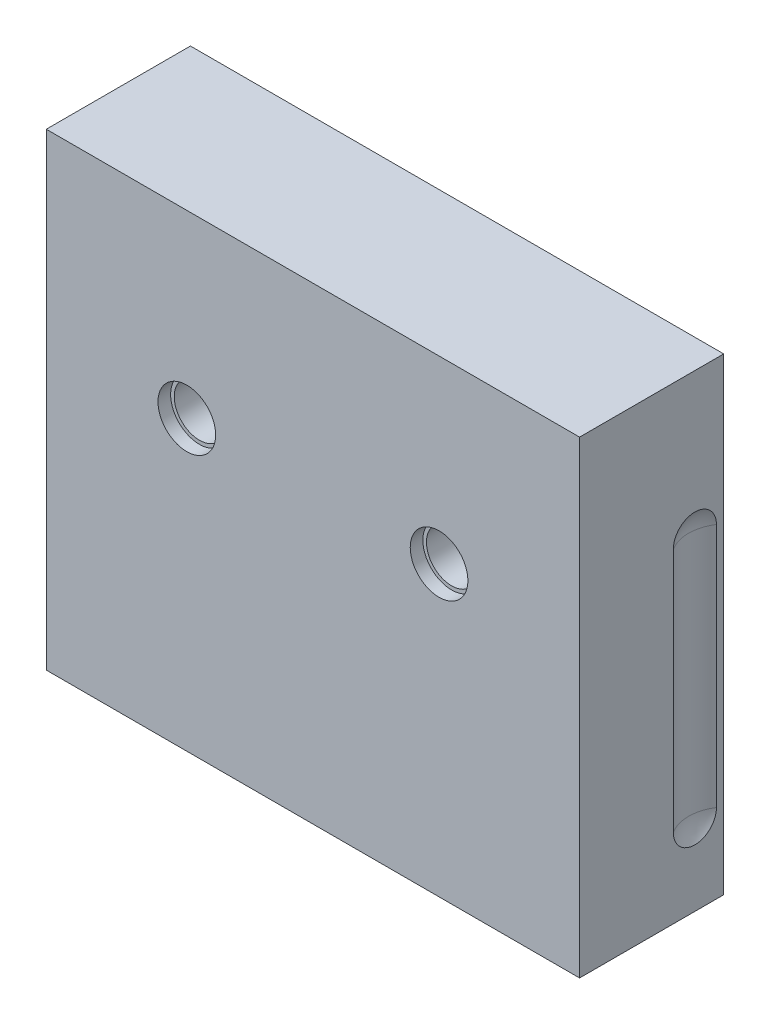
ISO-10303-21;
HEADER;
FILE_DESCRIPTION(('STEP AP214'),'2;1');
FILE_NAME('part.step','',(''),(''),'','','');
FILE_SCHEMA(('AUTOMOTIVE_DESIGN { 1 0 10303 214 1 1 1 1 }'));
ENDSEC;
DATA;
#1=APPLICATION_CONTEXT('core data for automotive mechanical design processes');
#2=APPLICATION_PROTOCOL_DEFINITION('international standard','automotive_design',2000,#1);
#3=PRODUCT_CONTEXT('',#1,'mechanical');
#4=PRODUCT('Part','Part','',(#3));
#5=PRODUCT_RELATED_PRODUCT_CATEGORY('part','',(#4));
#6=PRODUCT_DEFINITION_FORMATION('','',#4);
#7=PRODUCT_DEFINITION_CONTEXT('part definition',#1,'design');
#8=PRODUCT_DEFINITION('design','',#6,#7);
#9=PRODUCT_DEFINITION_SHAPE('','',#8);
#10=(LENGTH_UNIT() NAMED_UNIT(*) SI_UNIT(.MILLI.,.METRE.));
#11=(NAMED_UNIT(*) PLANE_ANGLE_UNIT() SI_UNIT($,.RADIAN.));
#12=(NAMED_UNIT(*) SI_UNIT($,.STERADIAN.) SOLID_ANGLE_UNIT());
#13=UNCERTAINTY_MEASURE_WITH_UNIT(LENGTH_MEASURE(1.E-05),#10,'distance_accuracy_value','');
#14=(GEOMETRIC_REPRESENTATION_CONTEXT(3) GLOBAL_UNCERTAINTY_ASSIGNED_CONTEXT((#13)) GLOBAL_UNIT_ASSIGNED_CONTEXT((#10,
#11,#12)) REPRESENTATION_CONTEXT('',''));
#15=CARTESIAN_POINT('',(0.,0.,0.));
#16=DIRECTION('',(0.,0.,1.));
#17=DIRECTION('',(1.,0.,0.));
#18=AXIS2_PLACEMENT_3D('',#15,#16,#17);
#19=CARTESIAN_POINT('',(83.9999999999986,335.999999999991,8.0000000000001));
#20=DIRECTION('',(0.,0.,-1.));
#21=DIRECTION('',(-1.,0.,0.));
#22=AXIS2_PLACEMENT_3D('',#19,#20,#21);
#23=CYLINDRICAL_SURFACE('',#22,4.2);
#24=CARTESIAN_POINT('',(83.9999999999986,335.999999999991,-5.));
#25=DIRECTION('',(0.,0.,-1.));
#26=DIRECTION('',(-1.,0.,0.));
#27=AXIS2_PLACEMENT_3D('',#24,#25,#26);
#28=CIRCLE('',#27,4.2);
#29=CARTESIAN_POINT('',(79.7999999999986,335.999999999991,-5.));
#30=VERTEX_POINT('',#29);
#31=EDGE_CURVE('E18',#30,#30,#28,.T.);
#32=ORIENTED_EDGE('',*,*,#31,.T.);
#33=EDGE_LOOP('',(#32));
#34=FACE_BOUND('',#33,.T.);
#35=CARTESIAN_POINT('',(83.9999999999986,335.999999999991,6.61435935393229));
#36=DIRECTION('',(0.,0.,1.));
#37=DIRECTION('',(-1.,0.,0.));
#38=AXIS2_PLACEMENT_3D('',#35,#36,#37);
#39=CIRCLE('',#38,4.1999999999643);
#40=CARTESIAN_POINT('',(79.8000000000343,335.999999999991,6.61435935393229));
#41=VERTEX_POINT('',#40);
#42=EDGE_CURVE('E330',#41,#41,#39,.T.);
#43=ORIENTED_EDGE('',*,*,#42,.T.);
#44=EDGE_LOOP('',(#43));
#45=FACE_BOUND('',#44,.T.);
#46=ADVANCED_FACE('F14',(#34,#45),#23,.F.);
#47=CARTESIAN_POINT('',(13.9999999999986,335.999999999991,8.));
#48=DIRECTION('',(0.,0.,-1.));
#49=DIRECTION('',(-1.,0.,0.));
#50=AXIS2_PLACEMENT_3D('',#47,#48,#49);
#51=CYLINDRICAL_SURFACE('',#50,4.2);
#52=CARTESIAN_POINT('',(13.9999999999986,335.999999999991,-5.));
#53=DIRECTION('',(0.,0.,-1.));
#54=DIRECTION('',(-1.,0.,0.));
#55=AXIS2_PLACEMENT_3D('',#52,#53,#54);
#56=CIRCLE('',#55,4.2);
#57=CARTESIAN_POINT('',(9.79999999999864,335.999999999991,-5.));
#58=VERTEX_POINT('',#57);
#59=EDGE_CURVE('E321',#58,#58,#56,.T.);
#60=ORIENTED_EDGE('',*,*,#59,.T.);
#61=EDGE_LOOP('',(#60));
#62=FACE_BOUND('',#61,.T.);
#63=CARTESIAN_POINT('',(13.9999999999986,335.999999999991,6.61435935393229));
#64=DIRECTION('',(0.,0.,1.));
#65=DIRECTION('',(-1.,0.,0.));
#66=AXIS2_PLACEMENT_3D('',#63,#64,#65);
#67=CIRCLE('',#66,4.20000000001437);
#68=CARTESIAN_POINT('',(9.79999999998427,335.999999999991,6.61435935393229));
#69=VERTEX_POINT('',#68);
#70=EDGE_CURVE('E326',#69,#69,#67,.T.);
#71=ORIENTED_EDGE('',*,*,#70,.T.);
#72=EDGE_LOOP('',(#71));
#73=FACE_BOUND('',#72,.T.);
#74=ADVANCED_FACE('F1302',(#62,#73),#51,.F.);
#75=CARTESIAN_POINT('',(83.9999999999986,335.999999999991,7.99999999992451));
#76=DIRECTION('',(0.,0.,1.));
#77=DIRECTION('',(1.,0.,0.));
#78=AXIS2_PLACEMENT_3D('',#75,#76,#77);
#79=CONICAL_SURFACE('',#78,4.99999999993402,0.523598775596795);
#80=CARTESIAN_POINT('',(83.9999999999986,335.999999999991,8.0000000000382));
#81=DIRECTION('',(0.,0.,1.));
#82=DIRECTION('',(1.,0.,0.));
#83=AXIS2_PLACEMENT_3D('',#80,#81,#82);
#84=CIRCLE('',#83,4.99999999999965);
#85=CARTESIAN_POINT('',(88.9999999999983,335.999999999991,8.0000000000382));
#86=VERTEX_POINT('',#85);
#87=EDGE_CURVE('E319',#86,#86,#84,.T.);
#88=ORIENTED_EDGE('',*,*,#87,.T.);
#89=EDGE_LOOP('',(#88));
#90=FACE_BOUND('',#89,.T.);
#91=ORIENTED_EDGE('',*,*,#42,.F.);
#92=EDGE_LOOP('',(#91));
#93=FACE_BOUND('',#92,.T.);
#94=ADVANCED_FACE('F1293',(#90,#93),#79,.F.);
#95=CARTESIAN_POINT('',(13.9999999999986,335.999999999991,7.99999999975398));
#96=DIRECTION('',(0.,0.,1.));
#97=DIRECTION('',(1.,0.,0.));
#98=AXIS2_PLACEMENT_3D('',#95,#96,#97);
#99=CONICAL_SURFACE('',#98,4.9999999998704,0.523598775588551);
#100=CARTESIAN_POINT('',(13.9999999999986,335.999999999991,7.99999999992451));
#101=DIRECTION('',(0.,0.,1.));
#102=DIRECTION('',(1.,0.,0.));
#103=AXIS2_PLACEMENT_3D('',#100,#101,#102);
#104=CIRCLE('',#103,4.99999999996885);
#105=CARTESIAN_POINT('',(18.9999999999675,335.999999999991,7.99999999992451));
#106=VERTEX_POINT('',#105);
#107=EDGE_CURVE('E284',#106,#106,#104,.T.);
#108=ORIENTED_EDGE('',*,*,#107,.T.);
#109=EDGE_LOOP('',(#108));
#110=FACE_BOUND('',#109,.T.);
#111=ORIENTED_EDGE('',*,*,#70,.F.);
#112=EDGE_LOOP('',(#111));
#113=FACE_BOUND('',#112,.T.);
#114=ADVANCED_FACE('F1285',(#110,#113),#99,.F.);
#115=CARTESIAN_POINT('',(83.9999999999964,335.999999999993,-5.));
#116=DIRECTION('',(0.,0.,1.));
#117=DIRECTION('',(0.,-1.,0.));
#118=AXIS2_PLACEMENT_3D('',#115,#116,#117);
#119=PLANE('',#118);
#120=DIRECTION('',(-0.707106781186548,-0.707106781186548,0.));
#121=VECTOR('',#120,1.);
#122=CARTESIAN_POINT('',(82.1375906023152,341.703633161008,-5.));
#123=LINE('',#122,#121);
#124=CARTESIAN_POINT('',(82.1375906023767,341.703633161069,-4.99999999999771));
#125=VERTEX_POINT('',#124);
#126=CARTESIAN_POINT('',(78.2963668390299,337.862409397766,-4.99999999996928));
#127=VERTEX_POINT('',#126);
#128=EDGE_CURVE('E1547',#125,#127,#123,.T.);
#129=ORIENTED_EDGE('',*,*,#128,.F.);
#130=CARTESIAN_POINT('',(83.9999999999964,335.999999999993,-4.99999999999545));
#131=DIRECTION('',(0.,0.,1.));
#132=DIRECTION('',(1.,0.,0.));
#133=AXIS2_PLACEMENT_3D('',#130,#131,#132);
#134=CIRCLE('',#133,6.00000000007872);
#135=CARTESIAN_POINT('',(85.8624093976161,341.703633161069,-4.99999999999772));
#136=VERTEX_POINT('',#135);
#137=EDGE_CURVE('E636',#136,#125,#134,.T.);
#138=ORIENTED_EDGE('',*,*,#137,.F.);
#139=DIRECTION('',(-0.707106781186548,0.707106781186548,0.));
#140=VECTOR('',#139,1.);
#141=CARTESIAN_POINT('',(89.7036331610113,337.862409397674,-5.));
#142=LINE('',#141,#140);
#143=CARTESIAN_POINT('',(89.7036331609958,337.862409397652,-5.0000000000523));
#144=VERTEX_POINT('',#143);
#145=EDGE_CURVE('E280',#144,#136,#142,.T.);
#146=ORIENTED_EDGE('',*,*,#145,.F.);
#147=CARTESIAN_POINT('',(83.9999999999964,335.999999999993,-5.0000000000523));
#148=DIRECTION('',(0.,0.,1.));
#149=DIRECTION('',(1.,0.,0.));
#150=AXIS2_PLACEMENT_3D('',#147,#148,#149);
#151=CIRCLE('',#150,5.99999999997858);
#152=CARTESIAN_POINT('',(89.7036331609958,334.137590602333,-5.00000000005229));
#153=VERTEX_POINT('',#152);
#154=EDGE_CURVE('E273',#153,#144,#151,.T.);
#155=ORIENTED_EDGE('',*,*,#154,.F.);
#156=DIRECTION('',(0.707106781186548,0.707106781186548,0.));
#157=VECTOR('',#156,1.);
#158=CARTESIAN_POINT('',(85.8624093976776,330.296366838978,-5.));
#159=LINE('',#158,#157);
#160=CARTESIAN_POINT('',(85.86240939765,330.296366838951,-4.99999999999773));
#161=VERTEX_POINT('',#160);
#162=EDGE_CURVE('E262',#161,#153,#159,.T.);
#163=ORIENTED_EDGE('',*,*,#162,.F.);
#164=CARTESIAN_POINT('',(83.9999999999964,335.999999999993,-4.99999999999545));
#165=DIRECTION('',(0.,0.,1.));
#166=DIRECTION('',(1.,0.,0.));
#167=AXIS2_PLACEMENT_3D('',#164,#165,#166);
#168=CIRCLE('',#167,6.00000000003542);
#169=CARTESIAN_POINT('',(82.1375906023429,330.296366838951,-4.99999999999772));
#170=VERTEX_POINT('',#169);
#171=EDGE_CURVE('E291',#170,#161,#168,.T.);
#172=ORIENTED_EDGE('',*,*,#171,.F.);
#173=DIRECTION('',(0.70710678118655,-0.707106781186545,0.));
#174=VECTOR('',#173,1.);
#175=CARTESIAN_POINT('',(78.2963668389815,334.137590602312,-5.));
#176=LINE('',#175,#174);
#177=CARTESIAN_POINT('',(78.2963668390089,334.137590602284,-4.9999999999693));
#178=VERTEX_POINT('',#177);
#179=EDGE_CURVE('E1562',#178,#170,#176,.T.);
#180=ORIENTED_EDGE('',*,*,#179,.F.);
#181=CARTESIAN_POINT('',(83.9999999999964,335.999999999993,-4.99999999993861));
#182=DIRECTION('',(0.,0.,1.));
#183=DIRECTION('',(1.,0.,0.));
#184=AXIS2_PLACEMENT_3D('',#181,#182,#183);
#185=CIRCLE('',#184,5.99999999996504);
#186=EDGE_CURVE('E1555',#127,#178,#185,.T.);
#187=ORIENTED_EDGE('',*,*,#186,.F.);
#188=EDGE_LOOP('',(#129,#138,#146,#155,#163,#172,#180,#187));
#189=FACE_BOUND('',#188,.T.);
#190=ORIENTED_EDGE('',*,*,#31,.F.);
#191=EDGE_LOOP('',(#190));
#192=FACE_BOUND('',#191,.T.);
#193=ADVANCED_FACE('F277',(#189,#192),#119,.F.);
#194=CARTESIAN_POINT('',(14.000000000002,335.999999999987,-5.));
#195=DIRECTION('',(0.,0.,1.));
#196=DIRECTION('',(0.,-1.,0.));
#197=AXIS2_PLACEMENT_3D('',#194,#195,#196);
#198=PLANE('',#197);
#199=DIRECTION('',(0.707106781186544,0.707106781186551,0.));
#200=VECTOR('',#199,1.);
#201=CARTESIAN_POINT('',(15.8624093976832,330.296366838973,-4.99999999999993));
#202=LINE('',#201,#200);
#203=CARTESIAN_POINT('',(15.862409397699,330.296366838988,-5.00000000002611));
#204=VERTEX_POINT('',#203);
#205=CARTESIAN_POINT('',(19.100000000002,333.533957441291,-5.));
#206=VERTEX_POINT('',#205);
#207=EDGE_CURVE('E635',#204,#206,#202,.T.);
#208=ORIENTED_EDGE('',*,*,#207,.F.);
#209=CARTESIAN_POINT('',(14.000000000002,335.999999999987,-5.0000000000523));
#210=DIRECTION('',(0.,0.,1.));
#211=DIRECTION('',(1.,0.,0.));
#212=AXIS2_PLACEMENT_3D('',#209,#210,#211);
#213=CIRCLE('',#212,5.99999999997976);
#214=CARTESIAN_POINT('',(12.1375906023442,330.296366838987,-5.0000000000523));
#215=VERTEX_POINT('',#214);
#216=EDGE_CURVE('E585',#215,#204,#213,.T.);
#217=ORIENTED_EDGE('',*,*,#216,.F.);
#218=DIRECTION('',(0.70710678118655,-0.707106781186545,0.));
#219=VECTOR('',#218,1.);
#220=CARTESIAN_POINT('',(8.90000000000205,333.533957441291,-5.));
#221=LINE('',#220,#219);
#222=CARTESIAN_POINT('',(8.90000000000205,333.533957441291,-5.));
#223=VERTEX_POINT('',#222);
#224=EDGE_CURVE('E580',#223,#215,#221,.T.);
#225=ORIENTED_EDGE('',*,*,#224,.F.);
#226=DIRECTION('',(0.,1.,0.));
#227=VECTOR('',#226,1.);
#228=CARTESIAN_POINT('',(8.90000000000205,337.100265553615,-5.));
#229=LINE('',#228,#227);
#230=CARTESIAN_POINT('',(8.90000000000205,338.466042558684,-5.));
#231=VERTEX_POINT('',#230);
#232=EDGE_CURVE('E549',#231,#223,#229,.F.);
#233=ORIENTED_EDGE('',*,*,#232,.F.);
#234=DIRECTION('',(-0.707106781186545,-0.70710678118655,0.));
#235=VECTOR('',#234,1.);
#236=CARTESIAN_POINT('',(12.1375906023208,341.703633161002,-4.99999999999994));
#237=LINE('',#236,#235);
#238=CARTESIAN_POINT('',(12.137590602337,341.703633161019,-5.00000000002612));
#239=VERTEX_POINT('',#238);
#240=EDGE_CURVE('E536',#239,#231,#237,.T.);
#241=ORIENTED_EDGE('',*,*,#240,.F.);
#242=CARTESIAN_POINT('',(14.000000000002,335.999999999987,-5.00000000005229));
#243=DIRECTION('',(0.,0.,1.));
#244=DIRECTION('',(1.,0.,0.));
#245=AXIS2_PLACEMENT_3D('',#242,#243,#244);
#246=CIRCLE('',#245,6.00000000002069);
#247=CARTESIAN_POINT('',(15.8624093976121,341.703633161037,-5.00000000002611));
#248=VERTEX_POINT('',#247);
#249=EDGE_CURVE('E625',#248,#239,#246,.T.);
#250=ORIENTED_EDGE('',*,*,#249,.F.);
#251=DIRECTION('',(-0.707106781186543,0.707106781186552,0.));
#252=VECTOR('',#251,1.);
#253=CARTESIAN_POINT('',(19.100000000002,338.466042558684,-5.));
#254=LINE('',#253,#252);
#255=CARTESIAN_POINT('',(19.100000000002,338.466042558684,-5.));
#256=VERTEX_POINT('',#255);
#257=EDGE_CURVE('E678',#256,#248,#254,.T.);
#258=ORIENTED_EDGE('',*,*,#257,.F.);
#259=DIRECTION('',(0.,1.,0.));
#260=VECTOR('',#259,1.);
#261=CARTESIAN_POINT('',(19.100000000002,337.100265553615,-5.));
#262=LINE('',#261,#260);
#263=EDGE_CURVE('E519',#206,#256,#262,.T.);
#264=ORIENTED_EDGE('',*,*,#263,.F.);
#265=EDGE_LOOP('',(#208,#217,#225,#233,#241,#250,#258,#264));
#266=FACE_BOUND('',#265,.T.);
#267=ORIENTED_EDGE('',*,*,#59,.F.);
#268=EDGE_LOOP('',(#267));
#269=FACE_BOUND('',#268,.T.);
#270=ADVANCED_FACE('F675',(#266,#269),#198,.F.);
#271=CARTESIAN_POINT('',(83.9999999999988,335.999999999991,8.0000000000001));
#272=DIRECTION('',(0.,0.,-1.));
#273=DIRECTION('',(-1.,0.,0.));
#274=AXIS2_PLACEMENT_3D('',#271,#272,#273);
#275=PLANE('',#274);
#276=CARTESIAN_POINT('',(83.9999999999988,335.999999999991,8.0000000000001));
#277=DIRECTION('',(0.,0.,1.));
#278=DIRECTION('',(1.,0.,0.));
#279=AXIS2_PLACEMENT_3D('',#276,#277,#278);
#280=CIRCLE('',#279,7.);
#281=CARTESIAN_POINT('',(90.9999999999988,335.999999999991,8.0000000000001));
#282=VERTEX_POINT('',#281);
#283=EDGE_CURVE('E525',#282,#282,#280,.T.);
#284=ORIENTED_EDGE('',*,*,#283,.T.);
#285=EDGE_LOOP('',(#284));
#286=FACE_BOUND('',#285,.T.);
#287=ORIENTED_EDGE('',*,*,#87,.F.);
#288=EDGE_LOOP('',(#287));
#289=FACE_BOUND('',#288,.T.);
#290=ADVANCED_FACE('F773',(#286,#289),#275,.F.);
#291=CARTESIAN_POINT('',(13.9999999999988,335.999999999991,8.));
#292=DIRECTION('',(0.,0.,-1.));
#293=DIRECTION('',(-1.,0.,0.));
#294=AXIS2_PLACEMENT_3D('',#291,#292,#293);
#295=PLANE('',#294);
#296=CARTESIAN_POINT('',(13.9999999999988,335.999999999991,8.));
#297=DIRECTION('',(0.,0.,1.));
#298=DIRECTION('',(1.,0.,0.));
#299=AXIS2_PLACEMENT_3D('',#296,#297,#298);
#300=CIRCLE('',#299,7.);
#301=CARTESIAN_POINT('',(20.9999999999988,335.999999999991,8.));
#302=VERTEX_POINT('',#301);
#303=EDGE_CURVE('E768',#302,#302,#300,.T.);
#304=ORIENTED_EDGE('',*,*,#303,.T.);
#305=EDGE_LOOP('',(#304));
#306=FACE_BOUND('',#305,.T.);
#307=ORIENTED_EDGE('',*,*,#107,.F.);
#308=EDGE_LOOP('',(#307));
#309=FACE_BOUND('',#308,.T.);
#310=ADVANCED_FACE('F1255',(#306,#309),#295,.F.);
#311=CARTESIAN_POINT('',(49.4849999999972,316.799999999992,11.6999999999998));
#312=DIRECTION('',(0.,0.,1.));
#313=DIRECTION('',(1.,0.,0.));
#314=AXIS2_PLACEMENT_3D('',#311,#312,#313);
#315=PLANE('',#314);
#316=CARTESIAN_POINT('',(41.9999999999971,342.799999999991,11.7));
#317=DIRECTION('',(0.,0.,-1.));
#318=DIRECTION('',(-1.,0.,0.));
#319=AXIS2_PLACEMENT_3D('',#316,#317,#318);
#320=CIRCLE('',#319,5.);
#321=CARTESIAN_POINT('',(41.9999999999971,347.799999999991,11.7));
#322=VERTEX_POINT('',#321);
#323=CARTESIAN_POINT('',(36.9999999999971,342.799999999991,11.7));
#324=VERTEX_POINT('',#323);
#325=EDGE_CURVE('E573',#322,#324,#320,.F.);
#326=ORIENTED_EDGE('',*,*,#325,.F.);
#327=DIRECTION('',(1.,0.,0.));
#328=VECTOR('',#327,1.);
#329=CARTESIAN_POINT('',(48.9999999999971,347.799999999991,11.7));
#330=LINE('',#329,#328);
#331=CARTESIAN_POINT('',(55.9999999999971,347.799999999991,11.7));
#332=VERTEX_POINT('',#331);
#333=EDGE_CURVE('E504',#332,#322,#330,.F.);
#334=ORIENTED_EDGE('',*,*,#333,.F.);
#335=CARTESIAN_POINT('',(55.9999999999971,342.799999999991,11.7));
#336=DIRECTION('',(0.,0.,-1.));
#337=DIRECTION('',(-1.,0.,0.));
#338=AXIS2_PLACEMENT_3D('',#335,#336,#337);
#339=CIRCLE('',#338,5.);
#340=CARTESIAN_POINT('',(60.9999999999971,342.799999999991,11.7));
#341=VERTEX_POINT('',#340);
#342=EDGE_CURVE('E501',#341,#332,#339,.F.);
#343=ORIENTED_EDGE('',*,*,#342,.F.);
#344=DIRECTION('',(0.,1.,0.));
#345=VECTOR('',#344,1.);
#346=CARTESIAN_POINT('',(60.9999999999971,320.999999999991,11.7));
#347=LINE('',#346,#345);
#348=CARTESIAN_POINT('',(60.9999999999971,299.199999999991,11.7));
#349=VERTEX_POINT('',#348);
#350=EDGE_CURVE('E498',#349,#341,#347,.T.);
#351=ORIENTED_EDGE('',*,*,#350,.F.);
#352=CARTESIAN_POINT('',(55.9999999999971,299.199999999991,11.7));
#353=DIRECTION('',(0.,0.,-1.));
#354=DIRECTION('',(-1.,0.,0.));
#355=AXIS2_PLACEMENT_3D('',#352,#353,#354);
#356=CIRCLE('',#355,5.);
#357=CARTESIAN_POINT('',(55.9999999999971,294.199999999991,11.7));
#358=VERTEX_POINT('',#357);
#359=EDGE_CURVE('E495',#358,#349,#356,.F.);
#360=ORIENTED_EDGE('',*,*,#359,.F.);
#361=DIRECTION('',(1.,0.,0.));
#362=VECTOR('',#361,1.);
#363=CARTESIAN_POINT('',(48.9999999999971,294.199999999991,11.7));
#364=LINE('',#363,#362);
#365=CARTESIAN_POINT('',(41.9999999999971,294.199999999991,11.7));
#366=VERTEX_POINT('',#365);
#367=EDGE_CURVE('E492',#366,#358,#364,.T.);
#368=ORIENTED_EDGE('',*,*,#367,.F.);
#369=CARTESIAN_POINT('',(41.9999999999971,299.199999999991,11.7));
#370=DIRECTION('',(0.,0.,-1.));
#371=DIRECTION('',(-1.,0.,0.));
#372=AXIS2_PLACEMENT_3D('',#369,#370,#371);
#373=CIRCLE('',#372,5.);
#374=CARTESIAN_POINT('',(36.9999999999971,299.199999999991,11.7));
#375=VERTEX_POINT('',#374);
#376=EDGE_CURVE('E489',#375,#366,#373,.F.);
#377=ORIENTED_EDGE('',*,*,#376,.F.);
#378=DIRECTION('',(0.,1.,0.));
#379=VECTOR('',#378,1.);
#380=CARTESIAN_POINT('',(36.9999999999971,320.999999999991,11.7));
#381=LINE('',#380,#379);
#382=EDGE_CURVE('E484',#324,#375,#381,.F.);
#383=ORIENTED_EDGE('',*,*,#382,.F.);
#384=EDGE_LOOP('',(#326,#334,#343,#351,#360,#368,#377,#383));
#385=FACE_BOUND('',#384,.T.);
#386=ADVANCED_FACE('F1248',(#385),#315,.F.);
#387=CARTESIAN_POINT('',(83.9999999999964,335.999999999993,-4.00000000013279));
#388=DIRECTION('',(0.,0.,1.));
#389=DIRECTION('',(1.,0.,0.));
#390=AXIS2_PLACEMENT_3D('',#387,#388,#389);
#391=CONICAL_SURFACE('',#390,6.99999999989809,0.785398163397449);
#392=CARTESIAN_POINT('',(89.7036331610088,334.137590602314,-5.00000000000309));
#393=CARTESIAN_POINT('',(90.1240370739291,333.879541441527,-4.5202612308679));
#394=CARTESIAN_POINT('',(90.5730946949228,333.592838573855,-4.00000000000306));
#395=B_SPLINE_CURVE_WITH_KNOTS('',2,(#392,#393,#394),.UNSPECIFIED.,.F.,.F.,(3,3),(0.,1.),.UNSPECIFIED.);
#396=CARTESIAN_POINT('',(90.573094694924,333.592838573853,-4.0000000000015));
#397=VERTEX_POINT('',#396);
#398=EDGE_CURVE('E267',#153,#397,#395,.T.);
#399=ORIENTED_EDGE('',*,*,#398,.F.);
#400=ORIENTED_EDGE('',*,*,#154,.T.);
#401=CARTESIAN_POINT('',(90.5730946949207,338.407161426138,-4.00000000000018));
#402=CARTESIAN_POINT('',(90.1240370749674,338.120458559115,-4.52026122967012));
#403=CARTESIAN_POINT('',(89.7036331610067,337.862409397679,-5.00000000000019));
#404=B_SPLINE_CURVE_WITH_KNOTS('',2,(#401,#402,#403),.UNSPECIFIED.,.F.,.F.,(3,3),(0.,1.),.UNSPECIFIED.);
#405=CARTESIAN_POINT('',(90.573094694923,338.407161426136,-4.00000000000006));
#406=VERTEX_POINT('',#405);
#407=EDGE_CURVE('E653',#406,#144,#404,.T.);
#408=ORIENTED_EDGE('',*,*,#407,.F.);
#409=CARTESIAN_POINT('',(83.9999999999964,335.999999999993,-4.));
#410=DIRECTION('',(0.,0.,1.));
#411=DIRECTION('',(1.,0.,0.));
#412=AXIS2_PLACEMENT_3D('',#409,#410,#411);
#413=CIRCLE('',#412,7.);
#414=EDGE_CURVE('E288',#397,#406,#413,.T.);
#415=ORIENTED_EDGE('',*,*,#414,.F.);
#416=EDGE_LOOP('',(#399,#400,#408,#415));
#417=FACE_BOUND('',#416,.T.);
#418=ADVANCED_FACE('F287',(#417),#391,.T.);
#419=CARTESIAN_POINT('',(89.1780579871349,332.904908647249,-4.5));
#420=DIRECTION('',(0.5,-0.5,-0.707106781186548));
#421=DIRECTION('',(-0.816496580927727,0.,-0.577350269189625));
#422=AXIS2_PLACEMENT_3D('',#419,#420,#421);
#423=PLANE('',#422);
#424=ORIENTED_EDGE('',*,*,#398,.T.);
#425=DIRECTION('',(0.707106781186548,0.707106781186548,0.));
#426=VECTOR('',#425,1.);
#427=CARTESIAN_POINT('',(90.5730946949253,333.592838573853,-4.));
#428=LINE('',#427,#426);
#429=CARTESIAN_POINT('',(86.4071614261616,329.426905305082,-3.99999999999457));
#430=VERTEX_POINT('',#429);
#431=EDGE_CURVE('E480',#430,#397,#428,.T.);
#432=ORIENTED_EDGE('',*,*,#431,.F.);
#433=CARTESIAN_POINT('',(85.8624093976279,330.296366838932,-4.99999999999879));
#434=CARTESIAN_POINT('',(85.9520100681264,330.150510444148,-4.83350671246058));
#435=CARTESIAN_POINT('',(86.0422064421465,330.00512706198,-4.66692666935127));
#436=CARTESIAN_POINT('',(86.2237904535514,329.715306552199,-4.33359333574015));
#437=CARTESIAN_POINT('',(86.3151780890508,329.570869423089,-4.16684004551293));
#438=CARTESIAN_POINT('',(86.4071614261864,329.426905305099,-3.99999999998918));
#439=B_SPLINE_CURVE_WITH_KNOTS('',3,(#433,#434,#435,#436,#437,#438),.UNSPECIFIED.,.F.,.F.,(4,2,
4),(0.,0.716369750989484,1.43273836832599),.UNSPECIFIED.);
#440=EDGE_CURVE('E269',#161,#430,#439,.T.);
#441=ORIENTED_EDGE('',*,*,#440,.F.);
#442=ORIENTED_EDGE('',*,*,#162,.T.);
#443=EDGE_LOOP('',(#424,#432,#441,#442));
#444=FACE_BOUND('',#443,.T.);
#445=ADVANCED_FACE('F264',(#444),#423,.T.);
#446=CARTESIAN_POINT('',(83.9999999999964,335.999999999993,-3.99999999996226));
#447=DIRECTION('',(0.,0.,1.));
#448=DIRECTION('',(1.,0.,0.));
#449=AXIS2_PLACEMENT_3D('',#446,#447,#448);
#450=CONICAL_SURFACE('',#449,7.00000000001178,0.785398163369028);
#451=CARTESIAN_POINT('',(82.1375906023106,330.296366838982,-4.99999999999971));
#452=CARTESIAN_POINT('',(81.8795414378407,329.875962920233,-4.52026122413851));
#453=CARTESIAN_POINT('',(81.5928385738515,329.426905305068,-3.99999999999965));
#454=B_SPLINE_CURVE_WITH_KNOTS('',2,(#451,#452,#453),.UNSPECIFIED.,.F.,.F.,(3,3),(0.,1.),.UNSPECIFIED.);
#455=CARTESIAN_POINT('',(81.5928385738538,329.426905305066,-3.9999999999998));
#456=VERTEX_POINT('',#455);
#457=EDGE_CURVE('E1568',#170,#456,#454,.T.);
#458=ORIENTED_EDGE('',*,*,#457,.F.);
#459=ORIENTED_EDGE('',*,*,#171,.T.);
#460=ORIENTED_EDGE('',*,*,#440,.T.);
#461=CARTESIAN_POINT('',(83.9999999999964,335.999999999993,-4.));
#462=DIRECTION('',(0.,0.,1.));
#463=DIRECTION('',(1.,0.,0.));
#464=AXIS2_PLACEMENT_3D('',#461,#462,#463);
#465=CIRCLE('',#464,7.);
#466=EDGE_CURVE('E477',#456,#430,#465,.T.);
#467=ORIENTED_EDGE('',*,*,#466,.F.);
#468=EDGE_LOOP('',(#458,#459,#460,#467));
#469=FACE_BOUND('',#468,.T.);
#470=ADVANCED_FACE('F305',(#469),#450,.T.);
#471=CARTESIAN_POINT('',(80.9049086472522,330.821942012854,-4.5));
#472=DIRECTION('',(-0.5,-0.5,-0.707106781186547));
#473=DIRECTION('',(0.,0.816496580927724,-0.577350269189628));
#474=AXIS2_PLACEMENT_3D('',#471,#472,#473);
#475=PLANE('',#474);
#476=ORIENTED_EDGE('',*,*,#457,.T.);
#477=DIRECTION('',(0.707106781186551,-0.707106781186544,0.));
#478=VECTOR('',#477,1.);
#479=CARTESIAN_POINT('',(81.592838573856,329.426905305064,-4.));
#480=LINE('',#479,#478);
#481=CARTESIAN_POINT('',(77.4269053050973,333.592838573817,-3.99999999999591));
#482=VERTEX_POINT('',#481);
#483=EDGE_CURVE('E474',#482,#456,#480,.T.);
#484=ORIENTED_EDGE('',*,*,#483,.F.);
#485=CARTESIAN_POINT('',(78.2963668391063,334.137590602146,-4.99999999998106));
#486=CARTESIAN_POINT('',(78.1505104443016,334.047989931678,-4.83350671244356));
#487=CARTESIAN_POINT('',(78.0051270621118,333.95779355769,-4.66692666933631));
#488=CARTESIAN_POINT('',(77.7153065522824,333.77620954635,-4.33359333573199));
#489=CARTESIAN_POINT('',(77.5708694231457,333.684821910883,-4.1668400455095));
#490=CARTESIAN_POINT('',(77.4269053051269,333.592838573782,-3.99999999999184));
#491=B_SPLINE_CURVE_WITH_KNOTS('',3,(#485,#486,#487,#488,#489,#490),.UNSPECIFIED.,.F.,.F.,(4,2,
4),(0.,0.716369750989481,1.43273836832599),.UNSPECIFIED.);
#492=EDGE_CURVE('E1570',#178,#482,#491,.T.);
#493=ORIENTED_EDGE('',*,*,#492,.F.);
#494=ORIENTED_EDGE('',*,*,#179,.T.);
#495=EDGE_LOOP('',(#476,#484,#493,#494));
#496=FACE_BOUND('',#495,.T.);
#497=ADVANCED_FACE('F1219',(#496),#475,.T.);
#498=CARTESIAN_POINT('',(83.9999999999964,335.999999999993,-4.00000000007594));
#499=DIRECTION('',(0.,0.,1.));
#500=DIRECTION('',(1.,0.,0.));
#501=AXIS2_PLACEMENT_3D('',#498,#499,#500);
#502=CONICAL_SURFACE('',#501,6.99999999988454,0.785398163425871);
#503=CARTESIAN_POINT('',(78.2963668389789,337.862409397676,-4.99999999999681));
#504=CARTESIAN_POINT('',(77.8759629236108,338.120458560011,-4.52026122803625));
#505=CARTESIAN_POINT('',(77.4269053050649,338.407161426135,-3.99999999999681));
#506=B_SPLINE_CURVE_WITH_KNOTS('',2,(#503,#504,#505),.UNSPECIFIED.,.F.,.F.,(3,3),(0.,1.),.UNSPECIFIED.);
#507=CARTESIAN_POINT('',(77.4269053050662,338.407161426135,-3.99999999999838));
#508=VERTEX_POINT('',#507);
#509=EDGE_CURVE('E1549',#127,#508,#506,.T.);
#510=ORIENTED_EDGE('',*,*,#509,.F.);
#511=ORIENTED_EDGE('',*,*,#186,.T.);
#512=ORIENTED_EDGE('',*,*,#492,.T.);
#513=CARTESIAN_POINT('',(83.9999999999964,335.999999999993,-4.));
#514=DIRECTION('',(0.,0.,1.));
#515=DIRECTION('',(1.,0.,0.));
#516=AXIS2_PLACEMENT_3D('',#513,#514,#515);
#517=CIRCLE('',#516,7.);
#518=EDGE_CURVE('E471',#508,#482,#517,.T.);
#519=ORIENTED_EDGE('',*,*,#518,.F.);
#520=EDGE_LOOP('',(#510,#511,#512,#519));
#521=FACE_BOUND('',#520,.T.);
#522=ADVANCED_FACE('F1211',(#521),#502,.T.);
#523=CARTESIAN_POINT('',(78.8219420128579,339.095091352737,-4.5));
#524=DIRECTION('',(-0.5,0.5,-0.707106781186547));
#525=DIRECTION('',(-0.816496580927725,0.,0.577350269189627));
#526=AXIS2_PLACEMENT_3D('',#523,#524,#525);
#527=PLANE('',#526);
#528=CARTESIAN_POINT('',(82.1375906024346,341.703633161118,-4.99999999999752));
#529=CARTESIAN_POINT('',(82.0479899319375,341.849489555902,-4.83350671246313));
#530=CARTESIAN_POINT('',(81.9577935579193,341.99487293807,-4.66692666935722));
#531=CARTESIAN_POINT('',(81.7762095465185,342.284693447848,-4.33359333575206));
#532=CARTESIAN_POINT('',(81.6848219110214,342.429130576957,-4.16684004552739));
#533=CARTESIAN_POINT('',(81.5928385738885,342.573094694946,-4.00000000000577));
#534=B_SPLINE_CURVE_WITH_KNOTS('',3,(#528,#529,#530,#531,#532,#533),.UNSPECIFIED.,.F.,.F.,(4,2,
4),(0.,0.716369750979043,1.43273836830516),.UNSPECIFIED.);
#535=CARTESIAN_POINT('',(81.5928385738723,342.573094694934,-4.00000000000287));
#536=VERTEX_POINT('',#535);
#537=EDGE_CURVE('E1544',#125,#536,#534,.T.);
#538=ORIENTED_EDGE('',*,*,#537,.F.);
#539=ORIENTED_EDGE('',*,*,#128,.T.);
#540=ORIENTED_EDGE('',*,*,#509,.T.);
#541=DIRECTION('',(-0.707106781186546,-0.707106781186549,0.));
#542=VECTOR('',#541,1.);
#543=CARTESIAN_POINT('',(77.4269053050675,338.407161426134,-4.));
#544=LINE('',#543,#542);
#545=EDGE_CURVE('E468',#536,#508,#544,.T.);
#546=ORIENTED_EDGE('',*,*,#545,.F.);
#547=EDGE_LOOP('',(#538,#539,#540,#546));
#548=FACE_BOUND('',#547,.T.);
#549=ADVANCED_FACE('F1203',(#548),#527,.T.);
#550=CARTESIAN_POINT('',(83.9999999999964,335.999999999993,-4.00000000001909));
#551=DIRECTION('',(0.,0.,1.));
#552=DIRECTION('',(1.,0.,0.));
#553=AXIS2_PLACEMENT_3D('',#550,#551,#552);
#554=CONICAL_SURFACE('',#553,6.99999999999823,0.785398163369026);
#555=CARTESIAN_POINT('',(85.862409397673,341.703633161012,-5.00000000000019));
#556=CARTESIAN_POINT('',(86.1204585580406,342.12403707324,-4.52026123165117));
#557=CARTESIAN_POINT('',(86.4071614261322,342.573094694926,-4.00000000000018));
#558=B_SPLINE_CURVE_WITH_KNOTS('',2,(#555,#556,#557),.UNSPECIFIED.,.F.,.F.,(3,3),(0.,1.),.UNSPECIFIED.);
#559=CARTESIAN_POINT('',(86.4071614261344,342.573094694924,-4.00000000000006));
#560=VERTEX_POINT('',#559);
#561=EDGE_CURVE('E657',#136,#560,#558,.T.);
#562=ORIENTED_EDGE('',*,*,#561,.F.);
#563=ORIENTED_EDGE('',*,*,#137,.T.);
#564=ORIENTED_EDGE('',*,*,#537,.T.);
#565=CARTESIAN_POINT('',(83.9999999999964,335.999999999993,-4.));
#566=DIRECTION('',(0.,0.,1.));
#567=DIRECTION('',(1.,0.,0.));
#568=AXIS2_PLACEMENT_3D('',#565,#566,#567);
#569=CIRCLE('',#568,7.);
#570=EDGE_CURVE('E465',#560,#536,#569,.T.);
#571=ORIENTED_EDGE('',*,*,#570,.F.);
#572=EDGE_LOOP('',(#562,#563,#564,#571));
#573=FACE_BOUND('',#572,.T.);
#574=ADVANCED_FACE('F647',(#573),#554,.T.);
#575=CARTESIAN_POINT('',(87.0950913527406,341.178057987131,-4.5));
#576=DIRECTION('',(0.5,0.5,-0.707106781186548));
#577=DIRECTION('',(-0.816496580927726,0.,-0.577350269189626));
#578=AXIS2_PLACEMENT_3D('',#575,#576,#577);
#579=PLANE('',#578);
#580=ORIENTED_EDGE('',*,*,#561,.T.);
#581=DIRECTION('',(-0.707106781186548,0.707106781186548,0.));
#582=VECTOR('',#581,1.);
#583=CARTESIAN_POINT('',(86.4071614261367,342.573094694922,-4.));
#584=LINE('',#583,#582);
#585=EDGE_CURVE('E459',#406,#560,#584,.T.);
#586=ORIENTED_EDGE('',*,*,#585,.F.);
#587=ORIENTED_EDGE('',*,*,#407,.T.);
#588=ORIENTED_EDGE('',*,*,#145,.T.);
#589=EDGE_LOOP('',(#580,#586,#587,#588));
#590=FACE_BOUND('',#589,.T.);
#591=ADVANCED_FACE('F642',(#590),#579,.T.);
#592=CARTESIAN_POINT('',(19.1780579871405,332.904908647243,-4.49999999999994));
#593=DIRECTION('',(0.5,-0.5,-0.707106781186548));
#594=DIRECTION('',(-0.816496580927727,0.,-0.577350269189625));
#595=AXIS2_PLACEMENT_3D('',#592,#593,#594);
#596=PLANE('',#595);
#597=CARTESIAN_POINT('',(15.8624093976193,330.296366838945,-5.00000000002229));
#598=CARTESIAN_POINT('',(15.952010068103,330.150510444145,-4.83350671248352));
#599=CARTESIAN_POINT('',(16.0422064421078,330.005127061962,-4.66692666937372));
#600=CARTESIAN_POINT('',(16.223790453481,329.715306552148,-4.33359333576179));
#601=CARTESIAN_POINT('',(16.3151780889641,329.570869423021,-4.16684004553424));
#602=CARTESIAN_POINT('',(16.4071614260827,329.426905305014,-4.00000000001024));
#603=B_SPLINE_CURVE_WITH_KNOTS('',3,(#597,#598,#599,#600,#601,#602),.UNSPECIFIED.,.F.,.F.,(4,2,
4),(0.,0.71636975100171,1.43273836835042),.UNSPECIFIED.);
#604=CARTESIAN_POINT('',(16.4071614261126,329.426905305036,-4.00000000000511));
#605=VERTEX_POINT('',#604);
#606=EDGE_CURVE('E629',#204,#605,#603,.T.);
#607=ORIENTED_EDGE('',*,*,#606,.F.);
#608=ORIENTED_EDGE('',*,*,#207,.T.);
#609=DIRECTION('',(-0.678598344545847,0.281084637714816,-0.678598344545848));
#610=VECTOR('',#609,1.);
#611=CARTESIAN_POINT('',(20.1000000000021,333.119743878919,-3.99999999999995));
#612=LINE('',#611,#610);
#613=CARTESIAN_POINT('',(20.1000000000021,333.119743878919,-3.99999999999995));
#614=VERTEX_POINT('',#613);
#615=EDGE_CURVE('E516',#614,#206,#612,.T.);
#616=ORIENTED_EDGE('',*,*,#615,.F.);
#617=DIRECTION('',(0.707106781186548,0.707106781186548,0.));
#618=VECTOR('',#617,1.);
#619=CARTESIAN_POINT('',(20.5730946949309,333.592838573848,-3.99999999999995));
#620=LINE('',#619,#618);
#621=EDGE_CURVE('E462',#605,#614,#620,.T.);
#622=ORIENTED_EDGE('',*,*,#621,.F.);
#623=EDGE_LOOP('',(#607,#608,#616,#622));
#624=FACE_BOUND('',#623,.T.);
#625=ADVANCED_FACE('F638',(#624),#596,.T.);
#626=CARTESIAN_POINT('',(14.000000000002,335.999999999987,-3.99999999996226));
#627=DIRECTION('',(0.,0.,1.));
#628=DIRECTION('',(1.,0.,0.));
#629=AXIS2_PLACEMENT_3D('',#626,#627,#628);
#630=CONICAL_SURFACE('',#629,7.0000000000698,0.785398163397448);
#631=CARTESIAN_POINT('',(12.1375906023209,330.296366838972,-4.99999999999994));
#632=CARTESIAN_POINT('',(11.8795414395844,329.875962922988,-4.52026122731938));
#633=CARTESIAN_POINT('',(11.5928385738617,329.426905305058,-3.99999999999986));
#634=B_SPLINE_CURVE_WITH_KNOTS('',2,(#631,#632,#633),.UNSPECIFIED.,.F.,.F.,(3,3),(0.,1.),.UNSPECIFIED.);
#635=CARTESIAN_POINT('',(11.5928385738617,329.426905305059,-3.99999999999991));
#636=VERTEX_POINT('',#635);
#637=EDGE_CURVE('E576',#215,#636,#634,.T.);
#638=ORIENTED_EDGE('',*,*,#637,.F.);
#639=ORIENTED_EDGE('',*,*,#216,.T.);
#640=ORIENTED_EDGE('',*,*,#606,.T.);
#641=CARTESIAN_POINT('',(14.000000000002,335.999999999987,-3.99999999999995));
#642=DIRECTION('',(0.,0.,1.));
#643=DIRECTION('',(1.,0.,0.));
#644=AXIS2_PLACEMENT_3D('',#641,#642,#643);
#645=CIRCLE('',#644,7.);
#646=EDGE_CURVE('E450',#636,#605,#645,.T.);
#647=ORIENTED_EDGE('',*,*,#646,.F.);
#648=EDGE_LOOP('',(#638,#639,#640,#647));
#649=FACE_BOUND('',#648,.T.);
#650=ADVANCED_FACE('F604',(#649),#630,.T.);
#651=CARTESIAN_POINT('',(10.9049086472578,330.821942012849,-4.49999999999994));
#652=DIRECTION('',(-0.5,-0.5,-0.707106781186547));
#653=DIRECTION('',(0.,0.816496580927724,-0.577350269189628));
#654=AXIS2_PLACEMENT_3D('',#651,#652,#653);
#655=PLANE('',#654);
#656=ORIENTED_EDGE('',*,*,#637,.T.);
#657=DIRECTION('',(0.707106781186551,-0.707106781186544,0.));
#658=VECTOR('',#657,1.);
#659=CARTESIAN_POINT('',(11.5928385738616,329.426905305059,-3.99999999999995));
#660=LINE('',#659,#658);
#661=CARTESIAN_POINT('',(7.90000000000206,333.119743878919,-3.99999999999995));
#662=VERTEX_POINT('',#661);
#663=EDGE_CURVE('E447',#662,#636,#660,.T.);
#664=ORIENTED_EDGE('',*,*,#663,.F.);
#665=DIRECTION('',(-0.67859834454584,-0.281084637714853,0.678598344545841));
#666=VECTOR('',#665,1.);
#667=CARTESIAN_POINT('',(8.90000000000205,333.533957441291,-5.));
#668=LINE('',#667,#666);
#669=EDGE_CURVE('E537',#223,#662,#668,.T.);
#670=ORIENTED_EDGE('',*,*,#669,.F.);
#671=ORIENTED_EDGE('',*,*,#224,.T.);
#672=EDGE_LOOP('',(#656,#664,#670,#671));
#673=FACE_BOUND('',#672,.T.);
#674=ADVANCED_FACE('F593',(#673),#655,.T.);
#675=CARTESIAN_POINT('',(8.33002133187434,337.100265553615,-4.43002133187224));
#676=DIRECTION('',(-0.707106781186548,0.,-0.707106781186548));
#677=DIRECTION('',(-0.707106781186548,0.,0.707106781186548));
#678=AXIS2_PLACEMENT_3D('',#675,#676,#677);
#679=PLANE('',#678);
#680=ORIENTED_EDGE('',*,*,#232,.T.);
#681=ORIENTED_EDGE('',*,*,#669,.T.);
#682=DIRECTION('',(0.,-1.,0.));
#683=VECTOR('',#682,1.);
#684=CARTESIAN_POINT('',(7.90000000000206,335.999999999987,-3.99999999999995));
#685=LINE('',#684,#683);
#686=CARTESIAN_POINT('',(7.90000000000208,338.880256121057,-3.99999999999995));
#687=VERTEX_POINT('',#686);
#688=EDGE_CURVE('E442',#687,#662,#685,.T.);
#689=ORIENTED_EDGE('',*,*,#688,.F.);
#690=DIRECTION('',(-0.678598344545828,0.281084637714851,0.678598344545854));
#691=VECTOR('',#690,1.);
#692=CARTESIAN_POINT('',(8.90000000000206,338.466042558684,-4.99999999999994));
#693=LINE('',#692,#691);
#694=EDGE_CURVE('E534',#231,#687,#693,.T.);
#695=ORIENTED_EDGE('',*,*,#694,.F.);
#696=EDGE_LOOP('',(#680,#681,#689,#695));
#697=FACE_BOUND('',#696,.T.);
#698=ADVANCED_FACE('F603',(#697),#679,.T.);
#699=CARTESIAN_POINT('',(8.82194201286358,339.095091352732,-4.49999999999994));
#700=DIRECTION('',(-0.5,0.5,-0.707106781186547));
#701=DIRECTION('',(-0.816496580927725,0.,0.577350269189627));
#702=AXIS2_PLACEMENT_3D('',#699,#700,#701);
#703=PLANE('',#702);
#704=CARTESIAN_POINT('',(12.1375906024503,341.703633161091,-5.00000000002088));
#705=CARTESIAN_POINT('',(12.0479899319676,341.849489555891,-4.83350671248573));
#706=CARTESIAN_POINT('',(11.9577935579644,341.994872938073,-4.6669266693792));
#707=CARTESIAN_POINT('',(11.7762095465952,342.284693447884,-4.3335933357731));
#708=CARTESIAN_POINT('',(11.6848219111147,342.42913057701,-4.16684004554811));
#709=CARTESIAN_POINT('',(11.592838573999,342.573094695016,-4.00000000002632));
#710=B_SPLINE_CURVE_WITH_KNOTS('',3,(#704,#705,#706,#707,#708,#709),.UNSPECIFIED.,.F.,.F.,(4,2,
4),(0.,0.716369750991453,1.43273836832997),.UNSPECIFIED.);
#711=CARTESIAN_POINT('',(11.5928385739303,342.573094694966,-4.00000000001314));
#712=VERTEX_POINT('',#711);
#713=EDGE_CURVE('E618',#239,#712,#710,.T.);
#714=ORIENTED_EDGE('',*,*,#713,.F.);
#715=ORIENTED_EDGE('',*,*,#240,.T.);
#716=ORIENTED_EDGE('',*,*,#694,.T.);
#717=DIRECTION('',(-0.707106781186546,-0.707106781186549,0.));
#718=VECTOR('',#717,1.);
#719=CARTESIAN_POINT('',(7.4269053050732,338.407161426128,-3.99999999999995));
#720=LINE('',#719,#718);
#721=EDGE_CURVE('E430',#712,#687,#720,.T.);
#722=ORIENTED_EDGE('',*,*,#721,.F.);
#723=EDGE_LOOP('',(#714,#715,#716,#722));
#724=FACE_BOUND('',#723,.T.);
#725=ADVANCED_FACE('F609',(#724),#703,.T.);
#726=CARTESIAN_POINT('',(14.000000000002,335.999999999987,-4.00000000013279));
#727=DIRECTION('',(0.,0.,1.));
#728=DIRECTION('',(1.,0.,0.));
#729=AXIS2_PLACEMENT_3D('',#726,#727,#728);
#730=CONICAL_SURFACE('',#729,6.9999999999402,0.785398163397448);
#731=CARTESIAN_POINT('',(15.862409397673,341.703633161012,-5.00000000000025));
#732=CARTESIAN_POINT('',(16.1204585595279,342.124037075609,-4.52026122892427));
#733=CARTESIAN_POINT('',(16.4071614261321,342.573094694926,-4.00000000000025));
#734=B_SPLINE_CURVE_WITH_KNOTS('',2,(#731,#732,#733),.UNSPECIFIED.,.F.,.F.,(3,3),(0.,1.),.UNSPECIFIED.);
#735=CARTESIAN_POINT('',(16.4071614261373,342.573094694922,-4.0000000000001));
#736=VERTEX_POINT('',#735);
#737=EDGE_CURVE('E520',#248,#736,#734,.T.);
#738=ORIENTED_EDGE('',*,*,#737,.F.);
#739=ORIENTED_EDGE('',*,*,#249,.T.);
#740=ORIENTED_EDGE('',*,*,#713,.T.);
#741=CARTESIAN_POINT('',(14.000000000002,335.999999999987,-3.99999999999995));
#742=DIRECTION('',(0.,0.,1.));
#743=DIRECTION('',(1.,0.,0.));
#744=AXIS2_PLACEMENT_3D('',#741,#742,#743);
#745=CIRCLE('',#744,7.);
#746=EDGE_CURVE('E427',#736,#712,#745,.T.);
#747=ORIENTED_EDGE('',*,*,#746,.F.);
#748=EDGE_LOOP('',(#738,#739,#740,#747));
#749=FACE_BOUND('',#748,.T.);
#750=ADVANCED_FACE('F613',(#749),#730,.T.);
#751=CARTESIAN_POINT('',(17.0950913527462,341.178057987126,-4.49999999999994));
#752=DIRECTION('',(0.5,0.5,-0.707106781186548));
#753=DIRECTION('',(-0.816496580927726,0.,-0.577350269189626));
#754=AXIS2_PLACEMENT_3D('',#751,#752,#753);
#755=PLANE('',#754);
#756=ORIENTED_EDGE('',*,*,#737,.T.);
#757=DIRECTION('',(-0.707106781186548,0.707106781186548,0.));
#758=VECTOR('',#757,1.);
#759=CARTESIAN_POINT('',(16.4071614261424,342.573094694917,-3.99999999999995));
#760=LINE('',#759,#758);
#761=CARTESIAN_POINT('',(20.1000000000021,338.880256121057,-3.99999999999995));
#762=VERTEX_POINT('',#761);
#763=EDGE_CURVE('E412',#762,#736,#760,.T.);
#764=ORIENTED_EDGE('',*,*,#763,.F.);
#765=DIRECTION('',(0.67859834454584,0.281084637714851,0.678598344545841));
#766=VECTOR('',#765,1.);
#767=CARTESIAN_POINT('',(19.100000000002,338.466042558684,-5.));
#768=LINE('',#767,#766);
#769=EDGE_CURVE('E523',#256,#762,#768,.T.);
#770=ORIENTED_EDGE('',*,*,#769,.F.);
#771=ORIENTED_EDGE('',*,*,#257,.T.);
#772=EDGE_LOOP('',(#756,#764,#770,#771));
#773=FACE_BOUND('',#772,.T.);
#774=ADVANCED_FACE('F685',(#773),#755,.T.);
#775=CARTESIAN_POINT('',(19.6699786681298,337.100265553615,-4.43002133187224));
#776=DIRECTION('',(0.707106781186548,0.,-0.707106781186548));
#777=DIRECTION('',(-0.707106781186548,0.,-0.707106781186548));
#778=AXIS2_PLACEMENT_3D('',#775,#776,#777);
#779=PLANE('',#778);
#780=ORIENTED_EDGE('',*,*,#263,.T.);
#781=ORIENTED_EDGE('',*,*,#769,.T.);
#782=DIRECTION('',(0.,1.,0.));
#783=VECTOR('',#782,1.);
#784=CARTESIAN_POINT('',(20.1000000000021,335.999999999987,-3.99999999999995));
#785=LINE('',#784,#783);
#786=EDGE_CURVE('E411',#614,#762,#785,.T.);
#787=ORIENTED_EDGE('',*,*,#786,.F.);
#788=ORIENTED_EDGE('',*,*,#615,.T.);
#789=EDGE_LOOP('',(#780,#781,#787,#788));
#790=FACE_BOUND('',#789,.T.);
#791=ADVANCED_FACE('F673',(#790),#779,.T.);
#792=CARTESIAN_POINT('',(83.9999999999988,335.999999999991,24.));
#793=DIRECTION('',(0.,0.,1.));
#794=DIRECTION('',(1.,0.,0.));
#795=AXIS2_PLACEMENT_3D('',#792,#793,#794);
#796=CYLINDRICAL_SURFACE('',#795,7.);
#797=ORIENTED_EDGE('',*,*,#283,.F.);
#798=EDGE_LOOP('',(#797));
#799=FACE_BOUND('',#798,.T.);
#800=CARTESIAN_POINT('',(83.9999999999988,335.999999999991,36.5));
#801=DIRECTION('',(0.,0.,1.));
#802=DIRECTION('',(1.,0.,0.));
#803=AXIS2_PLACEMENT_3D('',#800,#801,#802);
#804=CIRCLE('',#803,7.);
#805=CARTESIAN_POINT('',(90.9999999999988,335.999999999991,36.5));
#806=VERTEX_POINT('',#805);
#807=EDGE_CURVE('E453',#806,#806,#804,.T.);
#808=ORIENTED_EDGE('',*,*,#807,.T.);
#809=EDGE_LOOP('',(#808));
#810=FACE_BOUND('',#809,.T.);
#811=ADVANCED_FACE('F776',(#799,#810),#796,.F.);
#812=CARTESIAN_POINT('',(13.9999999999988,335.999999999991,24.));
#813=DIRECTION('',(0.,0.,1.));
#814=DIRECTION('',(1.,0.,0.));
#815=AXIS2_PLACEMENT_3D('',#812,#813,#814);
#816=CYLINDRICAL_SURFACE('',#815,7.);
#817=ORIENTED_EDGE('',*,*,#303,.F.);
#818=EDGE_LOOP('',(#817));
#819=FACE_BOUND('',#818,.T.);
#820=CARTESIAN_POINT('',(13.9999999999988,335.999999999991,36.5));
#821=DIRECTION('',(0.,0.,1.));
#822=DIRECTION('',(1.,0.,0.));
#823=AXIS2_PLACEMENT_3D('',#820,#821,#822);
#824=CIRCLE('',#823,7.);
#825=CARTESIAN_POINT('',(20.9999999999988,335.999999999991,36.5));
#826=VERTEX_POINT('',#825);
#827=EDGE_CURVE('E759',#826,#826,#824,.T.);
#828=ORIENTED_EDGE('',*,*,#827,.T.);
#829=EDGE_LOOP('',(#828));
#830=FACE_BOUND('',#829,.T.);
#831=ADVANCED_FACE('F779',(#819,#830),#816,.F.);
#832=CARTESIAN_POINT('',(41.9999999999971,342.799999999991,11.7));
#833=DIRECTION('',(0.,0.,-1.));
#834=DIRECTION('',(-1.,0.,0.));
#835=AXIS2_PLACEMENT_3D('',#832,#833,#834);
#836=CYLINDRICAL_SURFACE('',#835,5.);
#837=CARTESIAN_POINT('',(41.9999999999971,342.799999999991,0.));
#838=DIRECTION('',(0.,0.,-1.));
#839=DIRECTION('',(-1.,0.,0.));
#840=AXIS2_PLACEMENT_3D('',#837,#838,#839);
#841=CIRCLE('',#840,5.);
#842=CARTESIAN_POINT('',(36.9999999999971,342.799999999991,0.));
#843=VERTEX_POINT('',#842);
#844=CARTESIAN_POINT('',(41.9999999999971,347.799999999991,0.));
#845=VERTEX_POINT('',#844);
#846=EDGE_CURVE('E746',#843,#845,#841,.T.);
#847=ORIENTED_EDGE('',*,*,#846,.T.);
#848=DIRECTION('',(0.,0.,-1.));
#849=VECTOR('',#848,1.);
#850=CARTESIAN_POINT('',(41.9999999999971,347.799999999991,5.85));
#851=LINE('',#850,#849);
#852=EDGE_CURVE('E502',#322,#845,#851,.T.);
#853=ORIENTED_EDGE('',*,*,#852,.F.);
#854=ORIENTED_EDGE('',*,*,#325,.T.);
#855=DIRECTION('',(0.,0.,-1.));
#856=VECTOR('',#855,1.);
#857=CARTESIAN_POINT('',(36.9999999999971,342.799999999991,5.85));
#858=LINE('',#857,#856);
#859=EDGE_CURVE('E483',#843,#324,#858,.F.);
#860=ORIENTED_EDGE('',*,*,#859,.F.);
#861=EDGE_LOOP('',(#847,#853,#854,#860));
#862=FACE_BOUND('',#861,.T.);
#863=ADVANCED_FACE('F1121',(#862),#836,.F.);
#864=CARTESIAN_POINT('',(48.9999999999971,347.799999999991,5.85));
#865=DIRECTION('',(0.,-1.,0.));
#866=DIRECTION('',(0.,0.,-1.));
#867=AXIS2_PLACEMENT_3D('',#864,#865,#866);
#868=PLANE('',#867);
#869=ORIENTED_EDGE('',*,*,#852,.T.);
#870=DIRECTION('',(1.,0.,0.));
#871=VECTOR('',#870,1.);
#872=CARTESIAN_POINT('',(48.9999999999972,347.799999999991,0.));
#873=LINE('',#872,#871);
#874=CARTESIAN_POINT('',(55.9999999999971,347.799999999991,0.));
#875=VERTEX_POINT('',#874);
#876=EDGE_CURVE('E745',#845,#875,#873,.T.);
#877=ORIENTED_EDGE('',*,*,#876,.T.);
#878=DIRECTION('',(0.,0.,-1.));
#879=VECTOR('',#878,1.);
#880=CARTESIAN_POINT('',(55.9999999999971,347.799999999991,5.85));
#881=LINE('',#880,#879);
#882=EDGE_CURVE('E499',#332,#875,#881,.T.);
#883=ORIENTED_EDGE('',*,*,#882,.F.);
#884=ORIENTED_EDGE('',*,*,#333,.T.);
#885=EDGE_LOOP('',(#869,#877,#883,#884));
#886=FACE_BOUND('',#885,.T.);
#887=ADVANCED_FACE('F1112',(#886),#868,.T.);
#888=CARTESIAN_POINT('',(55.9999999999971,342.799999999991,11.7));
#889=DIRECTION('',(0.,0.,-1.));
#890=DIRECTION('',(-1.,0.,0.));
#891=AXIS2_PLACEMENT_3D('',#888,#889,#890);
#892=CYLINDRICAL_SURFACE('',#891,5.);
#893=CARTESIAN_POINT('',(55.9999999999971,342.799999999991,0.));
#894=DIRECTION('',(0.,0.,-1.));
#895=DIRECTION('',(-1.,0.,0.));
#896=AXIS2_PLACEMENT_3D('',#893,#894,#895);
#897=CIRCLE('',#896,5.);
#898=CARTESIAN_POINT('',(60.9999999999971,342.799999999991,0.));
#899=VERTEX_POINT('',#898);
#900=EDGE_CURVE('E742',#875,#899,#897,.T.);
#901=ORIENTED_EDGE('',*,*,#900,.T.);
#902=DIRECTION('',(0.,0.,1.));
#903=VECTOR('',#902,1.);
#904=CARTESIAN_POINT('',(60.9999999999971,342.799999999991,5.85));
#905=LINE('',#904,#903);
#906=EDGE_CURVE('E496',#341,#899,#905,.F.);
#907=ORIENTED_EDGE('',*,*,#906,.F.);
#908=ORIENTED_EDGE('',*,*,#342,.T.);
#909=ORIENTED_EDGE('',*,*,#882,.T.);
#910=EDGE_LOOP('',(#901,#907,#908,#909));
#911=FACE_BOUND('',#910,.T.);
#912=ADVANCED_FACE('F1103',(#911),#892,.F.);
#913=CARTESIAN_POINT('',(60.9999999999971,320.999999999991,5.85));
#914=DIRECTION('',(-1.,0.,0.));
#915=DIRECTION('',(0.,0.,1.));
#916=AXIS2_PLACEMENT_3D('',#913,#914,#915);
#917=PLANE('',#916);
#918=DIRECTION('',(0.,-1.,0.));
#919=VECTOR('',#918,1.);
#920=CARTESIAN_POINT('',(60.9999999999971,335.999999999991,0.));
#921=LINE('',#920,#919);
#922=CARTESIAN_POINT('',(60.9999999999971,299.199999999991,0.));
#923=VERTEX_POINT('',#922);
#924=EDGE_CURVE('E741',#899,#923,#921,.T.);
#925=ORIENTED_EDGE('',*,*,#924,.T.);
#926=DIRECTION('',(0.,0.,-1.));
#927=VECTOR('',#926,1.);
#928=CARTESIAN_POINT('',(60.9999999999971,299.199999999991,5.85));
#929=LINE('',#928,#927);
#930=EDGE_CURVE('E493',#349,#923,#929,.T.);
#931=ORIENTED_EDGE('',*,*,#930,.F.);
#932=ORIENTED_EDGE('',*,*,#350,.T.);
#933=ORIENTED_EDGE('',*,*,#906,.T.);
#934=EDGE_LOOP('',(#925,#931,#932,#933));
#935=FACE_BOUND('',#934,.T.);
#936=ADVANCED_FACE('F1094',(#935),#917,.T.);
#937=CARTESIAN_POINT('',(55.9999999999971,299.199999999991,11.7));
#938=DIRECTION('',(0.,0.,-1.));
#939=DIRECTION('',(-1.,0.,0.));
#940=AXIS2_PLACEMENT_3D('',#937,#938,#939);
#941=CYLINDRICAL_SURFACE('',#940,5.);
#942=CARTESIAN_POINT('',(55.9999999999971,299.199999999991,0.));
#943=DIRECTION('',(0.,0.,-1.));
#944=DIRECTION('',(-1.,0.,0.));
#945=AXIS2_PLACEMENT_3D('',#942,#943,#944);
#946=CIRCLE('',#945,5.);
#947=CARTESIAN_POINT('',(55.9999999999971,294.199999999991,0.));
#948=VERTEX_POINT('',#947);
#949=EDGE_CURVE('E738',#923,#948,#946,.T.);
#950=ORIENTED_EDGE('',*,*,#949,.T.);
#951=DIRECTION('',(0.,0.,1.));
#952=VECTOR('',#951,1.);
#953=CARTESIAN_POINT('',(55.9999999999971,294.199999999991,5.85));
#954=LINE('',#953,#952);
#955=EDGE_CURVE('E490',#358,#948,#954,.F.);
#956=ORIENTED_EDGE('',*,*,#955,.F.);
#957=ORIENTED_EDGE('',*,*,#359,.T.);
#958=ORIENTED_EDGE('',*,*,#930,.T.);
#959=EDGE_LOOP('',(#950,#956,#957,#958));
#960=FACE_BOUND('',#959,.T.);
#961=ADVANCED_FACE('F1085',(#960),#941,.F.);
#962=CARTESIAN_POINT('',(48.9999999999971,294.199999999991,5.85));
#963=DIRECTION('',(0.,1.,0.));
#964=DIRECTION('',(0.,0.,1.));
#965=AXIS2_PLACEMENT_3D('',#962,#963,#964);
#966=PLANE('',#965);
#967=DIRECTION('',(0.,0.,-1.));
#968=VECTOR('',#967,1.);
#969=CARTESIAN_POINT('',(41.9999999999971,294.199999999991,5.85));
#970=LINE('',#969,#968);
#971=CARTESIAN_POINT('',(41.9999999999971,294.199999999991,0.));
#972=VERTEX_POINT('',#971);
#973=EDGE_CURVE('E487',#366,#972,#970,.T.);
#974=ORIENTED_EDGE('',*,*,#973,.F.);
#975=ORIENTED_EDGE('',*,*,#367,.T.);
#976=ORIENTED_EDGE('',*,*,#955,.T.);
#977=DIRECTION('',(1.,0.,0.));
#978=VECTOR('',#977,1.);
#979=CARTESIAN_POINT('',(48.9999999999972,294.199999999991,0.));
#980=LINE('',#979,#978);
#981=EDGE_CURVE('E737',#948,#972,#980,.F.);
#982=ORIENTED_EDGE('',*,*,#981,.T.);
#983=EDGE_LOOP('',(#974,#975,#976,#982));
#984=FACE_BOUND('',#983,.T.);
#985=ADVANCED_FACE('F1076',(#984),#966,.T.);
#986=CARTESIAN_POINT('',(41.9999999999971,299.199999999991,11.7));
#987=DIRECTION('',(0.,0.,-1.));
#988=DIRECTION('',(-1.,0.,0.));
#989=AXIS2_PLACEMENT_3D('',#986,#987,#988);
#990=CYLINDRICAL_SURFACE('',#989,5.);
#991=CARTESIAN_POINT('',(41.9999999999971,299.199999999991,0.));
#992=DIRECTION('',(0.,0.,-1.));
#993=DIRECTION('',(-1.,0.,0.));
#994=AXIS2_PLACEMENT_3D('',#991,#992,#993);
#995=CIRCLE('',#994,5.);
#996=CARTESIAN_POINT('',(36.9999999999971,299.199999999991,0.));
#997=VERTEX_POINT('',#996);
#998=EDGE_CURVE('E734',#972,#997,#995,.T.);
#999=ORIENTED_EDGE('',*,*,#998,.T.);
#1000=DIRECTION('',(0.,0.,-1.));
#1001=VECTOR('',#1000,1.);
#1002=CARTESIAN_POINT('',(36.9999999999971,299.199999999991,5.85));
#1003=LINE('',#1002,#1001);
#1004=EDGE_CURVE('E481',#375,#997,#1003,.T.);
#1005=ORIENTED_EDGE('',*,*,#1004,.F.);
#1006=ORIENTED_EDGE('',*,*,#376,.T.);
#1007=ORIENTED_EDGE('',*,*,#973,.T.);
#1008=EDGE_LOOP('',(#999,#1005,#1006,#1007));
#1009=FACE_BOUND('',#1008,.T.);
#1010=ADVANCED_FACE('F1067',(#1009),#990,.F.);
#1011=CARTESIAN_POINT('',(36.9999999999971,320.999999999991,5.85));
#1012=DIRECTION('',(1.,0.,0.));
#1013=DIRECTION('',(0.,0.,-1.));
#1014=AXIS2_PLACEMENT_3D('',#1011,#1012,#1013);
#1015=PLANE('',#1014);
#1016=DIRECTION('',(0.,-1.,0.));
#1017=VECTOR('',#1016,1.);
#1018=CARTESIAN_POINT('',(36.9999999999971,335.999999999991,0.));
#1019=LINE('',#1018,#1017);
#1020=EDGE_CURVE('E733',#997,#843,#1019,.F.);
#1021=ORIENTED_EDGE('',*,*,#1020,.T.);
#1022=ORIENTED_EDGE('',*,*,#859,.T.);
#1023=ORIENTED_EDGE('',*,*,#382,.T.);
#1024=ORIENTED_EDGE('',*,*,#1004,.T.);
#1025=EDGE_LOOP('',(#1021,#1022,#1023,#1024));
#1026=FACE_BOUND('',#1025,.T.);
#1027=ADVANCED_FACE('F1058',(#1026),#1015,.T.);
#1028=CARTESIAN_POINT('',(83.9999999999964,335.999999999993,-5.));
#1029=DIRECTION('',(0.,0.,1.));
#1030=DIRECTION('',(1.,0.,0.));
#1031=AXIS2_PLACEMENT_3D('',#1028,#1029,#1030);
#1032=CYLINDRICAL_SURFACE('',#1031,7.);
#1033=CARTESIAN_POINT('',(83.9999999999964,335.999999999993,0.));
#1034=DIRECTION('',(0.,0.,1.));
#1035=DIRECTION('',(1.,0.,0.));
#1036=AXIS2_PLACEMENT_3D('',#1033,#1034,#1035);
#1037=CIRCLE('',#1036,7.);
#1038=CARTESIAN_POINT('',(90.5730946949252,338.407161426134,0.));
#1039=VERTEX_POINT('',#1038);
#1040=CARTESIAN_POINT('',(90.5730946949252,333.592838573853,0.));
#1041=VERTEX_POINT('',#1040);
#1042=EDGE_CURVE('E730',#1039,#1041,#1037,.F.);
#1043=ORIENTED_EDGE('',*,*,#1042,.T.);
#1044=DIRECTION('',(0.,0.,1.));
#1045=VECTOR('',#1044,1.);
#1046=CARTESIAN_POINT('',(90.5730946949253,333.592838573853,-5.));
#1047=LINE('',#1046,#1045);
#1048=EDGE_CURVE('E478',#397,#1041,#1047,.T.);
#1049=ORIENTED_EDGE('',*,*,#1048,.F.);
#1050=ORIENTED_EDGE('',*,*,#414,.T.);
#1051=DIRECTION('',(0.,0.,1.));
#1052=VECTOR('',#1051,1.);
#1053=CARTESIAN_POINT('',(90.5730946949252,338.407161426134,-5.));
#1054=LINE('',#1053,#1052);
#1055=EDGE_CURVE('E458',#1039,#406,#1054,.F.);
#1056=ORIENTED_EDGE('',*,*,#1055,.F.);
#1057=EDGE_LOOP('',(#1043,#1049,#1050,#1056));
#1058=FACE_BOUND('',#1057,.T.);
#1059=ADVANCED_FACE('F1049',(#1058),#1032,.T.);
#1060=CARTESIAN_POINT('',(90.5730946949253,333.592838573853,-5.));
#1061=DIRECTION('',(0.707106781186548,-0.707106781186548,0.));
#1062=DIRECTION('',(0.707106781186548,0.707106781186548,0.));
#1063=AXIS2_PLACEMENT_3D('',#1060,#1061,#1062);
#1064=PLANE('',#1063);
#1065=DIRECTION('',(-0.707106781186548,-0.707106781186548,0.));
#1066=VECTOR('',#1065,1.);
#1067=CARTESIAN_POINT('',(90.5730946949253,333.592838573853,0.));
#1068=LINE('',#1067,#1066);
#1069=CARTESIAN_POINT('',(86.4071614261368,329.426905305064,0.));
#1070=VERTEX_POINT('',#1069);
#1071=EDGE_CURVE('E729',#1041,#1070,#1068,.T.);
#1072=ORIENTED_EDGE('',*,*,#1071,.T.);
#1073=DIRECTION('',(0.,0.,1.));
#1074=VECTOR('',#1073,1.);
#1075=CARTESIAN_POINT('',(86.4071614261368,329.426905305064,-5.));
#1076=LINE('',#1075,#1074);
#1077=EDGE_CURVE('E475',#430,#1070,#1076,.T.);
#1078=ORIENTED_EDGE('',*,*,#1077,.F.);
#1079=ORIENTED_EDGE('',*,*,#431,.T.);
#1080=ORIENTED_EDGE('',*,*,#1048,.T.);
#1081=EDGE_LOOP('',(#1072,#1078,#1079,#1080));
#1082=FACE_BOUND('',#1081,.T.);
#1083=ADVANCED_FACE('F1040',(#1082),#1064,.T.);
#1084=CARTESIAN_POINT('',(83.9999999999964,335.999999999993,-5.));
#1085=DIRECTION('',(0.,0.,1.));
#1086=DIRECTION('',(1.,0.,0.));
#1087=AXIS2_PLACEMENT_3D('',#1084,#1085,#1086);
#1088=CYLINDRICAL_SURFACE('',#1087,7.);
#1089=CARTESIAN_POINT('',(83.9999999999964,335.999999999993,0.));
#1090=DIRECTION('',(0.,0.,1.));
#1091=DIRECTION('',(1.,0.,0.));
#1092=AXIS2_PLACEMENT_3D('',#1089,#1090,#1091);
#1093=CIRCLE('',#1092,7.);
#1094=CARTESIAN_POINT('',(81.5928385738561,329.426905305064,0.));
#1095=VERTEX_POINT('',#1094);
#1096=EDGE_CURVE('E726',#1070,#1095,#1093,.F.);
#1097=ORIENTED_EDGE('',*,*,#1096,.T.);
#1098=DIRECTION('',(0.,0.,1.));
#1099=VECTOR('',#1098,1.);
#1100=CARTESIAN_POINT('',(81.592838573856,329.426905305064,-5.));
#1101=LINE('',#1100,#1099);
#1102=EDGE_CURVE('E472',#456,#1095,#1101,.T.);
#1103=ORIENTED_EDGE('',*,*,#1102,.F.);
#1104=ORIENTED_EDGE('',*,*,#466,.T.);
#1105=ORIENTED_EDGE('',*,*,#1077,.T.);
#1106=EDGE_LOOP('',(#1097,#1103,#1104,#1105));
#1107=FACE_BOUND('',#1106,.T.);
#1108=ADVANCED_FACE('F1031',(#1107),#1088,.T.);
#1109=CARTESIAN_POINT('',(81.592838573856,329.426905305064,-5.));
#1110=DIRECTION('',(-0.707106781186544,-0.707106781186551,0.));
#1111=DIRECTION('',(0.707106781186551,-0.707106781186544,0.));
#1112=AXIS2_PLACEMENT_3D('',#1109,#1110,#1111);
#1113=PLANE('',#1112);
#1114=DIRECTION('',(-0.707106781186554,0.707106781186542,0.));
#1115=VECTOR('',#1114,1.);
#1116=CARTESIAN_POINT('',(81.592838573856,329.426905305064,0.));
#1117=LINE('',#1116,#1115);
#1118=CARTESIAN_POINT('',(77.4269053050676,333.592838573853,0.));
#1119=VERTEX_POINT('',#1118);
#1120=EDGE_CURVE('E725',#1095,#1119,#1117,.T.);
#1121=ORIENTED_EDGE('',*,*,#1120,.T.);
#1122=DIRECTION('',(0.,0.,1.));
#1123=VECTOR('',#1122,1.);
#1124=CARTESIAN_POINT('',(77.4269053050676,333.592838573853,-5.));
#1125=LINE('',#1124,#1123);
#1126=EDGE_CURVE('E469',#482,#1119,#1125,.T.);
#1127=ORIENTED_EDGE('',*,*,#1126,.F.);
#1128=ORIENTED_EDGE('',*,*,#483,.T.);
#1129=ORIENTED_EDGE('',*,*,#1102,.T.);
#1130=EDGE_LOOP('',(#1121,#1127,#1128,#1129));
#1131=FACE_BOUND('',#1130,.T.);
#1132=ADVANCED_FACE('F1022',(#1131),#1113,.T.);
#1133=CARTESIAN_POINT('',(83.9999999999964,335.999999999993,-5.));
#1134=DIRECTION('',(0.,0.,1.));
#1135=DIRECTION('',(1.,0.,0.));
#1136=AXIS2_PLACEMENT_3D('',#1133,#1134,#1135);
#1137=CYLINDRICAL_SURFACE('',#1136,7.);
#1138=CARTESIAN_POINT('',(83.9999999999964,335.999999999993,0.));
#1139=DIRECTION('',(0.,0.,1.));
#1140=DIRECTION('',(1.,0.,0.));
#1141=AXIS2_PLACEMENT_3D('',#1138,#1139,#1140);
#1142=CIRCLE('',#1141,7.);
#1143=CARTESIAN_POINT('',(77.4269053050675,338.407161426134,0.));
#1144=VERTEX_POINT('',#1143);
#1145=EDGE_CURVE('E722',#1119,#1144,#1142,.F.);
#1146=ORIENTED_EDGE('',*,*,#1145,.T.);
#1147=DIRECTION('',(0.,0.,1.));
#1148=VECTOR('',#1147,1.);
#1149=CARTESIAN_POINT('',(77.4269053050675,338.407161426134,-5.));
#1150=LINE('',#1149,#1148);
#1151=EDGE_CURVE('E466',#508,#1144,#1150,.T.);
#1152=ORIENTED_EDGE('',*,*,#1151,.F.);
#1153=ORIENTED_EDGE('',*,*,#518,.T.);
#1154=ORIENTED_EDGE('',*,*,#1126,.T.);
#1155=EDGE_LOOP('',(#1146,#1152,#1153,#1154));
#1156=FACE_BOUND('',#1155,.T.);
#1157=ADVANCED_FACE('F1013',(#1156),#1137,.T.);
#1158=CARTESIAN_POINT('',(77.4269053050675,338.407161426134,-5.));
#1159=DIRECTION('',(-0.707106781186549,0.707106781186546,0.));
#1160=DIRECTION('',(-0.707106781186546,-0.707106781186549,0.));
#1161=AXIS2_PLACEMENT_3D('',#1158,#1159,#1160);
#1162=PLANE('',#1161);
#1163=DIRECTION('',(0.707106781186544,0.707106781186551,0.));
#1164=VECTOR('',#1163,1.);
#1165=CARTESIAN_POINT('',(77.4269053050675,338.407161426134,0.));
#1166=LINE('',#1165,#1164);
#1167=CARTESIAN_POINT('',(81.5928385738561,342.573094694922,0.));
#1168=VERTEX_POINT('',#1167);
#1169=EDGE_CURVE('E721',#1144,#1168,#1166,.T.);
#1170=ORIENTED_EDGE('',*,*,#1169,.T.);
#1171=DIRECTION('',(0.,0.,1.));
#1172=VECTOR('',#1171,1.);
#1173=CARTESIAN_POINT('',(81.5928385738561,342.573094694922,-5.));
#1174=LINE('',#1173,#1172);
#1175=EDGE_CURVE('E463',#536,#1168,#1174,.T.);
#1176=ORIENTED_EDGE('',*,*,#1175,.F.);
#1177=ORIENTED_EDGE('',*,*,#545,.T.);
#1178=ORIENTED_EDGE('',*,*,#1151,.T.);
#1179=EDGE_LOOP('',(#1170,#1176,#1177,#1178));
#1180=FACE_BOUND('',#1179,.T.);
#1181=ADVANCED_FACE('F1004',(#1180),#1162,.T.);
#1182=CARTESIAN_POINT('',(83.9999999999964,335.999999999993,-5.));
#1183=DIRECTION('',(0.,0.,1.));
#1184=DIRECTION('',(1.,0.,0.));
#1185=AXIS2_PLACEMENT_3D('',#1182,#1183,#1184);
#1186=CYLINDRICAL_SURFACE('',#1185,7.);
#1187=CARTESIAN_POINT('',(83.9999999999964,335.999999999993,0.));
#1188=DIRECTION('',(0.,0.,1.));
#1189=DIRECTION('',(1.,0.,0.));
#1190=AXIS2_PLACEMENT_3D('',#1187,#1188,#1189);
#1191=CIRCLE('',#1190,7.);
#1192=CARTESIAN_POINT('',(86.4071614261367,342.573094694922,0.));
#1193=VERTEX_POINT('',#1192);
#1194=EDGE_CURVE('E718',#1168,#1193,#1191,.F.);
#1195=ORIENTED_EDGE('',*,*,#1194,.T.);
#1196=DIRECTION('',(0.,0.,1.));
#1197=VECTOR('',#1196,1.);
#1198=CARTESIAN_POINT('',(86.4071614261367,342.573094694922,-5.));
#1199=LINE('',#1198,#1197);
#1200=EDGE_CURVE('E456',#560,#1193,#1199,.T.);
#1201=ORIENTED_EDGE('',*,*,#1200,.F.);
#1202=ORIENTED_EDGE('',*,*,#570,.T.);
#1203=ORIENTED_EDGE('',*,*,#1175,.T.);
#1204=EDGE_LOOP('',(#1195,#1201,#1202,#1203));
#1205=FACE_BOUND('',#1204,.T.);
#1206=ADVANCED_FACE('F995',(#1205),#1186,.T.);
#1207=CARTESIAN_POINT('',(86.4071614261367,342.573094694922,-5.));
#1208=DIRECTION('',(0.707106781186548,0.707106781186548,0.));
#1209=DIRECTION('',(-0.707106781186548,0.707106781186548,0.));
#1210=AXIS2_PLACEMENT_3D('',#1207,#1208,#1209);
#1211=PLANE('',#1210);
#1212=DIRECTION('',(0.70710678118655,-0.707106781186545,0.));
#1213=VECTOR('',#1212,1.);
#1214=CARTESIAN_POINT('',(86.4071614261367,342.573094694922,0.));
#1215=LINE('',#1214,#1213);
#1216=EDGE_CURVE('E712',#1193,#1039,#1215,.T.);
#1217=ORIENTED_EDGE('',*,*,#1216,.T.);
#1218=ORIENTED_EDGE('',*,*,#1055,.T.);
#1219=ORIENTED_EDGE('',*,*,#585,.T.);
#1220=ORIENTED_EDGE('',*,*,#1200,.T.);
#1221=EDGE_LOOP('',(#1217,#1218,#1219,#1220));
#1222=FACE_BOUND('',#1221,.T.);
#1223=ADVANCED_FACE('F987',(#1222),#1211,.T.);
#1224=CARTESIAN_POINT('',(20.5730946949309,333.592838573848,-5.));
#1225=DIRECTION('',(0.707106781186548,-0.707106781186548,0.));
#1226=DIRECTION('',(0.707106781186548,0.707106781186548,0.));
#1227=AXIS2_PLACEMENT_3D('',#1224,#1225,#1226);
#1228=PLANE('',#1227);
#1229=DIRECTION('',(0.,0.,1.));
#1230=VECTOR('',#1229,1.);
#1231=CARTESIAN_POINT('',(16.4071614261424,329.426905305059,-5.));
#1232=LINE('',#1231,#1230);
#1233=CARTESIAN_POINT('',(16.4071614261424,329.426905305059,0.));
#1234=VERTEX_POINT('',#1233);
#1235=EDGE_CURVE('E448',#605,#1234,#1232,.T.);
#1236=ORIENTED_EDGE('',*,*,#1235,.F.);
#1237=ORIENTED_EDGE('',*,*,#621,.T.);
#1238=DIRECTION('',(0.,0.,1.));
#1239=VECTOR('',#1238,1.);
#1240=CARTESIAN_POINT('',(20.1000000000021,333.119743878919,0.));
#1241=LINE('',#1240,#1239);
#1242=CARTESIAN_POINT('',(20.1000000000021,333.119743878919,0.));
#1243=VERTEX_POINT('',#1242);
#1244=EDGE_CURVE('E422',#1243,#614,#1241,.F.);
#1245=ORIENTED_EDGE('',*,*,#1244,.F.);
#1246=DIRECTION('',(-0.707106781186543,-0.707106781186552,0.));
#1247=VECTOR('',#1246,1.);
#1248=CARTESIAN_POINT('',(20.1000000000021,333.119743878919,0.));
#1249=LINE('',#1248,#1247);
#1250=EDGE_CURVE('E695',#1243,#1234,#1249,.T.);
#1251=ORIENTED_EDGE('',*,*,#1250,.T.);
#1252=EDGE_LOOP('',(#1236,#1237,#1245,#1251));
#1253=FACE_BOUND('',#1252,.T.);
#1254=ADVANCED_FACE('F694',(#1253),#1228,.T.);
#1255=CARTESIAN_POINT('',(14.000000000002,335.999999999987,-5.));
#1256=DIRECTION('',(0.,0.,1.));
#1257=DIRECTION('',(1.,0.,0.));
#1258=AXIS2_PLACEMENT_3D('',#1255,#1256,#1257);
#1259=CYLINDRICAL_SURFACE('',#1258,7.);
#1260=CARTESIAN_POINT('',(14.000000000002,335.999999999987,0.));
#1261=DIRECTION('',(0.,0.,1.));
#1262=DIRECTION('',(1.,0.,0.));
#1263=AXIS2_PLACEMENT_3D('',#1260,#1261,#1262);
#1264=CIRCLE('',#1263,7.);
#1265=CARTESIAN_POINT('',(11.5928385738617,329.426905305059,0.));
#1266=VERTEX_POINT('',#1265);
#1267=EDGE_CURVE('E701',#1234,#1266,#1264,.F.);
#1268=ORIENTED_EDGE('',*,*,#1267,.T.);
#1269=DIRECTION('',(0.,0.,1.));
#1270=VECTOR('',#1269,1.);
#1271=CARTESIAN_POINT('',(11.5928385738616,329.426905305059,-5.));
#1272=LINE('',#1271,#1270);
#1273=EDGE_CURVE('E445',#636,#1266,#1272,.T.);
#1274=ORIENTED_EDGE('',*,*,#1273,.F.);
#1275=ORIENTED_EDGE('',*,*,#646,.T.);
#1276=ORIENTED_EDGE('',*,*,#1235,.T.);
#1277=EDGE_LOOP('',(#1268,#1274,#1275,#1276));
#1278=FACE_BOUND('',#1277,.T.);
#1279=ADVANCED_FACE('F699',(#1278),#1259,.T.);
#1280=CARTESIAN_POINT('',(11.5928385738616,329.426905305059,-5.));
#1281=DIRECTION('',(-0.707106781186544,-0.707106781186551,0.));
#1282=DIRECTION('',(0.707106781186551,-0.707106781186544,0.));
#1283=AXIS2_PLACEMENT_3D('',#1280,#1281,#1282);
#1284=PLANE('',#1283);
#1285=ORIENTED_EDGE('',*,*,#1273,.T.);
#1286=DIRECTION('',(-0.707106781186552,0.707106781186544,0.));
#1287=VECTOR('',#1286,1.);
#1288=CARTESIAN_POINT('',(11.5928385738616,329.426905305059,0.));
#1289=LINE('',#1288,#1287);
#1290=CARTESIAN_POINT('',(7.90000000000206,333.119743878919,0.));
#1291=VERTEX_POINT('',#1290);
#1292=EDGE_CURVE('E438',#1266,#1291,#1289,.T.);
#1293=ORIENTED_EDGE('',*,*,#1292,.T.);
#1294=DIRECTION('',(0.,0.,1.));
#1295=VECTOR('',#1294,1.);
#1296=CARTESIAN_POINT('',(7.90000000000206,333.119743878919,0.));
#1297=LINE('',#1296,#1295);
#1298=EDGE_CURVE('E431',#662,#1291,#1297,.T.);
#1299=ORIENTED_EDGE('',*,*,#1298,.F.);
#1300=ORIENTED_EDGE('',*,*,#663,.T.);
#1301=EDGE_LOOP('',(#1285,#1293,#1299,#1300));
#1302=FACE_BOUND('',#1301,.T.);
#1303=ADVANCED_FACE('F963',(#1302),#1284,.T.);
#1304=CARTESIAN_POINT('',(7.90000000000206,335.999999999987,0.));
#1305=DIRECTION('',(-1.,0.,0.));
#1306=DIRECTION('',(0.,-1.,0.));
#1307=AXIS2_PLACEMENT_3D('',#1304,#1305,#1306);
#1308=PLANE('',#1307);
#1309=DIRECTION('',(0.,-1.,0.));
#1310=VECTOR('',#1309,1.);
#1311=CARTESIAN_POINT('',(7.90000000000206,335.999999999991,0.));
#1312=LINE('',#1311,#1310);
#1313=CARTESIAN_POINT('',(7.90000000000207,338.880256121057,0.));
#1314=VERTEX_POINT('',#1313);
#1315=EDGE_CURVE('E434',#1291,#1314,#1312,.F.);
#1316=ORIENTED_EDGE('',*,*,#1315,.T.);
#1317=DIRECTION('',(0.,0.,1.));
#1318=VECTOR('',#1317,1.);
#1319=CARTESIAN_POINT('',(7.90000000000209,338.880256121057,-5.));
#1320=LINE('',#1319,#1318);
#1321=EDGE_CURVE('E428',#687,#1314,#1320,.T.);
#1322=ORIENTED_EDGE('',*,*,#1321,.F.);
#1323=ORIENTED_EDGE('',*,*,#688,.T.);
#1324=ORIENTED_EDGE('',*,*,#1298,.T.);
#1325=EDGE_LOOP('',(#1316,#1322,#1323,#1324));
#1326=FACE_BOUND('',#1325,.T.);
#1327=ADVANCED_FACE('F954',(#1326),#1308,.T.);
#1328=CARTESIAN_POINT('',(7.4269053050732,338.407161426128,-5.));
#1329=DIRECTION('',(-0.707106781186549,0.707106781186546,0.));
#1330=DIRECTION('',(-0.707106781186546,-0.707106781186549,0.));
#1331=AXIS2_PLACEMENT_3D('',#1328,#1329,#1330);
#1332=PLANE('',#1331);
#1333=DIRECTION('',(0.,0.,1.));
#1334=VECTOR('',#1333,1.);
#1335=CARTESIAN_POINT('',(11.5928385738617,342.573094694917,-5.));
#1336=LINE('',#1335,#1334);
#1337=CARTESIAN_POINT('',(11.5928385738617,342.573094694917,0.));
#1338=VERTEX_POINT('',#1337);
#1339=EDGE_CURVE('E425',#712,#1338,#1336,.T.);
#1340=ORIENTED_EDGE('',*,*,#1339,.F.);
#1341=ORIENTED_EDGE('',*,*,#721,.T.);
#1342=ORIENTED_EDGE('',*,*,#1321,.T.);
#1343=DIRECTION('',(0.707106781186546,0.707106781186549,0.));
#1344=VECTOR('',#1343,1.);
#1345=CARTESIAN_POINT('',(7.90000000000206,338.880256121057,0.));
#1346=LINE('',#1345,#1344);
#1347=EDGE_CURVE('E437',#1314,#1338,#1346,.T.);
#1348=ORIENTED_EDGE('',*,*,#1347,.T.);
#1349=EDGE_LOOP('',(#1340,#1341,#1342,#1348));
#1350=FACE_BOUND('',#1349,.T.);
#1351=ADVANCED_FACE('F945',(#1350),#1332,.T.);
#1352=CARTESIAN_POINT('',(14.000000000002,335.999999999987,-5.));
#1353=DIRECTION('',(0.,0.,1.));
#1354=DIRECTION('',(1.,0.,0.));
#1355=AXIS2_PLACEMENT_3D('',#1352,#1353,#1354);
#1356=CYLINDRICAL_SURFACE('',#1355,7.);
#1357=CARTESIAN_POINT('',(14.000000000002,335.999999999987,0.));
#1358=DIRECTION('',(0.,0.,1.));
#1359=DIRECTION('',(1.,0.,0.));
#1360=AXIS2_PLACEMENT_3D('',#1357,#1358,#1359);
#1361=CIRCLE('',#1360,7.);
#1362=CARTESIAN_POINT('',(16.4071614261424,342.573094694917,0.));
#1363=VERTEX_POINT('',#1362);
#1364=EDGE_CURVE('E716',#1338,#1363,#1361,.F.);
#1365=ORIENTED_EDGE('',*,*,#1364,.T.);
#1366=DIRECTION('',(0.,0.,1.));
#1367=VECTOR('',#1366,1.);
#1368=CARTESIAN_POINT('',(16.4071614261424,342.573094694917,-5.));
#1369=LINE('',#1368,#1367);
#1370=EDGE_CURVE('E409',#736,#1363,#1369,.T.);
#1371=ORIENTED_EDGE('',*,*,#1370,.F.);
#1372=ORIENTED_EDGE('',*,*,#746,.T.);
#1373=ORIENTED_EDGE('',*,*,#1339,.T.);
#1374=EDGE_LOOP('',(#1365,#1371,#1372,#1373));
#1375=FACE_BOUND('',#1374,.T.);
#1376=ADVANCED_FACE('F938',(#1375),#1356,.T.);
#1377=CARTESIAN_POINT('',(16.4071614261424,342.573094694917,-5.));
#1378=DIRECTION('',(0.707106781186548,0.707106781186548,0.));
#1379=DIRECTION('',(-0.707106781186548,0.707106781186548,0.));
#1380=AXIS2_PLACEMENT_3D('',#1377,#1378,#1379);
#1381=PLANE('',#1380);
#1382=ORIENTED_EDGE('',*,*,#1370,.T.);
#1383=DIRECTION('',(0.707106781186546,-0.707106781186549,0.));
#1384=VECTOR('',#1383,1.);
#1385=CARTESIAN_POINT('',(16.4071614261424,342.573094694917,0.));
#1386=LINE('',#1385,#1384);
#1387=CARTESIAN_POINT('',(20.1000000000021,338.880256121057,0.));
#1388=VERTEX_POINT('',#1387);
#1389=EDGE_CURVE('E417',#1363,#1388,#1386,.T.);
#1390=ORIENTED_EDGE('',*,*,#1389,.T.);
#1391=DIRECTION('',(0.,0.,1.));
#1392=VECTOR('',#1391,1.);
#1393=CARTESIAN_POINT('',(20.1000000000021,338.880256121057,0.));
#1394=LINE('',#1393,#1392);
#1395=EDGE_CURVE('E420',#762,#1388,#1394,.T.);
#1396=ORIENTED_EDGE('',*,*,#1395,.F.);
#1397=ORIENTED_EDGE('',*,*,#763,.T.);
#1398=EDGE_LOOP('',(#1382,#1390,#1396,#1397));
#1399=FACE_BOUND('',#1398,.T.);
#1400=ADVANCED_FACE('F796',(#1399),#1381,.T.);
#1401=CARTESIAN_POINT('',(20.1000000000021,335.999999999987,0.));
#1402=DIRECTION('',(1.,0.,0.));
#1403=DIRECTION('',(0.,1.,0.));
#1404=AXIS2_PLACEMENT_3D('',#1401,#1402,#1403);
#1405=PLANE('',#1404);
#1406=DIRECTION('',(0.,-1.,0.));
#1407=VECTOR('',#1406,1.);
#1408=CARTESIAN_POINT('',(20.1000000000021,335.999999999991,0.));
#1409=LINE('',#1408,#1407);
#1410=EDGE_CURVE('E413',#1388,#1243,#1409,.T.);
#1411=ORIENTED_EDGE('',*,*,#1410,.T.);
#1412=ORIENTED_EDGE('',*,*,#1244,.T.);
#1413=ORIENTED_EDGE('',*,*,#786,.T.);
#1414=ORIENTED_EDGE('',*,*,#1395,.T.);
#1415=EDGE_LOOP('',(#1411,#1412,#1413,#1414));
#1416=FACE_BOUND('',#1415,.T.);
#1417=ADVANCED_FACE('F688',(#1416),#1405,.T.);
#1418=CARTESIAN_POINT('',(83.9999999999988,335.999999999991,36.5));
#1419=DIRECTION('',(0.,0.,-1.));
#1420=DIRECTION('',(-1.,0.,0.));
#1421=AXIS2_PLACEMENT_3D('',#1418,#1419,#1420);
#1422=PLANE('',#1421);
#1423=CARTESIAN_POINT('',(83.9999999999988,335.999999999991,36.5));
#1424=DIRECTION('',(0.,0.,-1.));
#1425=DIRECTION('',(-1.,0.,0.));
#1426=AXIS2_PLACEMENT_3D('',#1423,#1424,#1425);
#1427=CIRCLE('',#1426,8.);
#1428=CARTESIAN_POINT('',(75.9999999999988,335.999999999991,36.5));
#1429=VERTEX_POINT('',#1428);
#1430=EDGE_CURVE('E416',#1429,#1429,#1427,.F.);
#1431=ORIENTED_EDGE('',*,*,#1430,.T.);
#1432=EDGE_LOOP('',(#1431));
#1433=FACE_BOUND('',#1432,.T.);
#1434=ORIENTED_EDGE('',*,*,#807,.F.);
#1435=EDGE_LOOP('',(#1434));
#1436=FACE_BOUND('',#1435,.T.);
#1437=ADVANCED_FACE('F783',(#1433,#1436),#1422,.F.);
#1438=CARTESIAN_POINT('',(13.9999999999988,335.999999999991,36.5));
#1439=DIRECTION('',(0.,0.,-1.));
#1440=DIRECTION('',(-1.,0.,0.));
#1441=AXIS2_PLACEMENT_3D('',#1438,#1439,#1440);
#1442=PLANE('',#1441);
#1443=CARTESIAN_POINT('',(13.9999999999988,335.999999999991,36.5));
#1444=DIRECTION('',(0.,0.,-1.));
#1445=DIRECTION('',(-1.,0.,0.));
#1446=AXIS2_PLACEMENT_3D('',#1443,#1444,#1445);
#1447=CIRCLE('',#1446,8.);
#1448=CARTESIAN_POINT('',(5.9999999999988,335.999999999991,36.5));
#1449=VERTEX_POINT('',#1448);
#1450=EDGE_CURVE('E1458',#1449,#1449,#1447,.F.);
#1451=ORIENTED_EDGE('',*,*,#1450,.T.);
#1452=EDGE_LOOP('',(#1451));
#1453=FACE_BOUND('',#1452,.T.);
#1454=ORIENTED_EDGE('',*,*,#827,.F.);
#1455=EDGE_LOOP('',(#1454));
#1456=FACE_BOUND('',#1455,.T.);
#1457=ADVANCED_FACE('F785',(#1453,#1456),#1442,.F.);
#1458=CARTESIAN_POINT('',(-34.2900000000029,277.983176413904,8.));
#1459=DIRECTION('',(0.567112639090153,0.449602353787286,0.690102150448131));
#1460=DIRECTION('',(-0.807268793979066,0.469642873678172,0.357425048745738));
#1461=AXIS2_PLACEMENT_3D('',#1458,#1459,#1460);
#1462=SPHERICAL_SURFACE('',#1461,11.05);
#1463=CARTESIAN_POINT('',(-34.2900000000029,277.983176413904,8.));
#1464=DIRECTION('',(0.,-1.,0.));
#1465=DIRECTION('',(1.,0.,0.));
#1466=AXIS2_PLACEMENT_3D('',#1463,#1464,#1465);
#1467=CIRCLE('',#1466,11.05);
#1468=CARTESIAN_POINT('',(-25.0000000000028,277.983176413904,13.9831764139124));
#1469=VERTEX_POINT('',#1468);
#1470=CARTESIAN_POINT('',(-25.0000000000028,277.983176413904,2.01682358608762));
#1471=VERTEX_POINT('',#1470);
#1472=EDGE_CURVE('E757',#1469,#1471,#1467,.F.);
#1473=ORIENTED_EDGE('',*,*,#1472,.T.);
#1474=CARTESIAN_POINT('',(-25.0000000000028,277.983176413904,2.0168235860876));
#1475=CARTESIAN_POINT('',(-25.0000000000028,277.81489769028,2.01680549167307));
#1476=CARTESIAN_POINT('',(-25.0000000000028,277.646621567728,2.02392216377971));
#1477=CARTESIAN_POINT('',(-25.0000000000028,277.311273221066,2.05229435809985));
#1478=CARTESIAN_POINT('',(-25.0000000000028,277.144200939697,2.07354920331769));
#1479=CARTESIAN_POINT('',(-25.0000000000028,276.812559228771,2.13004722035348));
#1480=CARTESIAN_POINT('',(-25.0000000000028,276.64798812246,2.16528054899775));
#1481=CARTESIAN_POINT('',(-25.0000000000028,276.322399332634,2.24947920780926));
#1482=CARTESIAN_POINT('',(-25.0000000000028,276.161381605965,2.29844437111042));
#1483=CARTESIAN_POINT('',(-25.0000000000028,275.843996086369,2.40977649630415));
#1484=CARTESIAN_POINT('',(-25.0000000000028,275.687629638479,2.47214729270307));
#1485=CARTESIAN_POINT('',(-25.0000000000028,275.380649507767,2.60986414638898));
#1486=CARTESIAN_POINT('',(-25.0000000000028,275.230037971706,2.68521498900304));
#1487=CARTESIAN_POINT('',(-25.0000000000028,274.935783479,2.84829392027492));
#1488=CARTESIAN_POINT('',(-25.0000000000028,274.792136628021,2.9360149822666));
#1489=CARTESIAN_POINT('',(-25.0000000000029,274.512689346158,3.12327780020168));
#1490=CARTESIAN_POINT('',(-25.000000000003,274.376891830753,3.22282390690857));
#1491=CARTESIAN_POINT('',(-25.000000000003,274.114211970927,3.43296654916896));
#1492=CARTESIAN_POINT('',(-25.0000000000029,273.987326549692,3.54355923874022));
#1493=CARTESIAN_POINT('',(-25.0000000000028,273.743275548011,3.77508084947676));
#1494=CARTESIAN_POINT('',(-25.0000000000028,273.62611357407,3.89601357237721));
#1495=CARTESIAN_POINT('',(-25.0000000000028,273.402419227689,4.14729281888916));
#1496=CARTESIAN_POINT('',(-25.0000000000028,273.295884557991,4.27763729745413));
#1497=CARTESIAN_POINT('',(-25.0000000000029,273.094135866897,4.54688657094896));
#1498=CARTESIAN_POINT('',(-25.000000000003,272.998926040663,4.6857945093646));
#1499=CARTESIAN_POINT('',(-25.000000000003,272.820586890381,4.97108006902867));
#1500=CARTESIAN_POINT('',(-25.0000000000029,272.737452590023,5.11745457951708));
#1501=CARTESIAN_POINT('',(-25.0000000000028,272.583780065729,5.41674113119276));
#1502=CARTESIAN_POINT('',(-25.0000000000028,272.513246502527,5.56965556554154));
#1503=CARTESIAN_POINT('',(-25.0000000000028,272.38534256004,5.88081641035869));
#1504=CARTESIAN_POINT('',(-25.0000000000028,272.327966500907,6.03906048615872));
#1505=CARTESIAN_POINT('',(-25.0000000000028,272.226727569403,6.35987794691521));
#1506=CARTESIAN_POINT('',(-25.0000000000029,272.182869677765,6.52245290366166));
#1507=CARTESIAN_POINT('',(-25.0000000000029,272.109020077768,6.85066453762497));
#1508=CARTESIAN_POINT('',(-25.0000000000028,272.079023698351,7.01630016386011));
#1509=CARTESIAN_POINT('',(-25.0000000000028,272.033080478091,7.34956736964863));
#1510=CARTESIAN_POINT('',(-25.0000000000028,272.017138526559,7.51719962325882));
#1511=CARTESIAN_POINT('',(-25.0000000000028,271.999436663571,7.85318588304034));
#1512=CARTESIAN_POINT('',(-25.0000000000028,271.997674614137,8.02153977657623));
#1513=CARTESIAN_POINT('',(-25.0000000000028,272.008339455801,8.35779754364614));
#1514=CARTESIAN_POINT('',(-25.0000000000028,272.020766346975,8.52570141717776));
#1515=CARTESIAN_POINT('',(-25.0000000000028,272.059723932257,8.85989285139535));
#1516=CARTESIAN_POINT('',(-25.0000000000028,272.086256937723,9.0261801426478));
#1517=CARTESIAN_POINT('',(-25.0000000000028,272.15322780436,9.35587042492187));
#1518=CARTESIAN_POINT('',(-25.0000000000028,272.193660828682,9.51927439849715));
#1519=CARTESIAN_POINT('',(-25.0000000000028,272.288163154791,9.84215345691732));
#1520=CARTESIAN_POINT('',(-25.0000000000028,272.342237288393,10.0016271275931));
#1521=CARTESIAN_POINT('',(-25.0000000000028,272.463607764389,10.3153933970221));
#1522=CARTESIAN_POINT('',(-25.0000000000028,272.530899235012,10.4696878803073));
#1523=CARTESIAN_POINT('',(-25.0000000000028,272.678267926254,10.7721206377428));
#1524=CARTESIAN_POINT('',(-25.0000000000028,272.758350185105,10.9202564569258));
#1525=CARTESIAN_POINT('',(-25.0000000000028,272.930679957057,11.2092001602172));
#1526=CARTESIAN_POINT('',(-25.0000000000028,273.022922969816,11.3500107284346));
#1527=CARTESIAN_POINT('',(-25.0000000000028,273.218972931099,11.6234057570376));
#1528=CARTESIAN_POINT('',(-25.0000000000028,273.322783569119,11.755987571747));
#1529=CARTESIAN_POINT('',(-25.0000000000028,273.541166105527,12.0118858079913));
#1530=CARTESIAN_POINT('',(-25.0000000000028,273.655734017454,12.1352056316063));
#1531=CARTESIAN_POINT('',(-25.0000000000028,273.89487744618,12.3717854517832));
#1532=CARTESIAN_POINT('',(-25.0000000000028,274.019455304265,12.4850430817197));
#1533=CARTESIAN_POINT('',(-25.0000000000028,274.277661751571,12.7006208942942));
#1534=CARTESIAN_POINT('',(-25.0000000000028,274.411286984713,12.8029450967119));
#1535=CARTESIAN_POINT('',(-25.0000000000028,274.686774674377,12.9960434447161));
#1536=CARTESIAN_POINT('',(-25.0000000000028,274.828642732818,13.0868095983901));
#1537=CARTESIAN_POINT('',(-25.0000000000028,275.11946944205,13.2560323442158));
#1538=CARTESIAN_POINT('',(-25.0000000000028,275.268425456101,13.3344934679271));
#1539=CARTESIAN_POINT('',(-25.0000000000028,275.572566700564,13.4786595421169));
#1540=CARTESIAN_POINT('',(-25.0000000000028,275.727757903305,13.5443518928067));
#1541=CARTESIAN_POINT('',(-25.0000000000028,276.043068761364,13.6623942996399));
#1542=CARTESIAN_POINT('',(-25.0000000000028,276.203186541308,13.7147493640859));
#1543=CARTESIAN_POINT('',(-25.0000000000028,276.527082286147,13.8057263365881));
#1544=CARTESIAN_POINT('',(-25.0000000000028,276.69085602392,13.8443633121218));
#1545=CARTESIAN_POINT('',(-25.0000000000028,277.021010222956,13.9076956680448));
#1546=CARTESIAN_POINT('',(-25.0000000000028,277.187389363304,13.932397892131));
#1547=CARTESIAN_POINT('',(-25.0000000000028,277.458971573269,13.9610951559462));
#1548=CARTESIAN_POINT('',(-25.0000000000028,277.56373991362,13.9693809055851));
#1549=CARTESIAN_POINT('',(-25.0000000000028,277.77339400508,13.9804175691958));
#1550=CARTESIAN_POINT('',(-25.0000000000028,277.878279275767,13.983177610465));
#1551=CARTESIAN_POINT('',(-25.0000000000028,277.983176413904,13.9831764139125));
#1552=B_SPLINE_CURVE_WITH_KNOTS('',3,(#1474,#1475,#1476,#1477,#1478,#1479,#1480,#1481,#1482,
#1483,#1484,#1485,#1486,#1487,#1488,#1489,#1490,#1491,#1492,#1493,#1494,#1495,#1496,#1497,#1498,
#1499,#1500,#1501,#1502,#1503,#1504,#1505,#1506,#1507,#1508,#1509,#1510,#1511,#1512,#1513,#1514,
#1515,#1516,#1517,#1518,#1519,#1520,#1521,#1522,#1523,#1524,#1525,#1526,#1527,#1528,#1529,#1530,
#1531,#1532,#1533,#1534,#1535,#1536,#1537,#1538,#1539,#1540,#1541,#1542,#1543,#1544,#1545,#1546,
#1547,#1548,#1549,#1550,#1551),.UNSPECIFIED.,.F.,.F.,(4,2,2,2,2,2,2,2,2,2,2,2,2,2,2,2,2,2,2,2,2,
2,2,2,2,2,2,2,2,2,2,2,2,2,2,2,2,2,4),(0.,0.504682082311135,1.0093400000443,1.51364318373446,
2.01794023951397,2.52238173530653,3.02700960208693,3.5313519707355,4.0358804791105,
4.54023393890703,5.0447736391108,5.54920403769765,6.05382071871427,6.55822885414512,
7.06282317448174,7.5671992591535,8.07176095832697,8.57615250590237,9.08071945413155,
9.58521032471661,10.0897011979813,10.5942747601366,11.0986729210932,11.6032499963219,
12.1076414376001,12.6122320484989,13.1166364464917,13.6212021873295,14.1255816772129,
14.6300794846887,15.1343911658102,15.6390496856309,16.1435219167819,16.6484894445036,
17.1532670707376,17.6574885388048,18.1614621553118,18.4766146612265,18.7912461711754),.UNSPECIFIED.);
#1553=EDGE_CURVE('E830',#1471,#1469,#1552,.T.);
#1554=ORIENTED_EDGE('',*,*,#1553,.T.);
#1555=EDGE_LOOP('',(#1473,#1554));
#1556=FACE_BOUND('',#1555,.T.);
#1557=ADVANCED_FACE('F793',(#1556),#1462,.F.);
#1558=CARTESIAN_POINT('',(-34.2900000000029,306.016823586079,8.));
#1559=DIRECTION('',(0.,-1.,0.));
#1560=DIRECTION('',(1.,0.,0.));
#1561=AXIS2_PLACEMENT_3D('',#1558,#1559,#1560);
#1562=CYLINDRICAL_SURFACE('',#1561,11.05);
#1563=ORIENTED_EDGE('',*,*,#1472,.F.);
#1564=DIRECTION('',(0.,1.,0.));
#1565=VECTOR('',#1564,1.);
#1566=CARTESIAN_POINT('',(-25.0000000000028,335.999999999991,13.9831764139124));
#1567=LINE('',#1566,#1565);
#1568=CARTESIAN_POINT('',(-25.0000000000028,346.016823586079,13.9831764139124));
#1569=VERTEX_POINT('',#1568);
#1570=EDGE_CURVE('E829',#1469,#1569,#1567,.T.);
#1571=ORIENTED_EDGE('',*,*,#1570,.T.);
#1572=CARTESIAN_POINT('',(-34.2900000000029,346.016823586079,8.));
#1573=DIRECTION('',(0.,-1.,0.));
#1574=DIRECTION('',(1.,0.,0.));
#1575=AXIS2_PLACEMENT_3D('',#1572,#1573,#1574);
#1576=CIRCLE('',#1575,11.05);
#1577=CARTESIAN_POINT('',(-25.0000000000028,346.016823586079,2.01682358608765));
#1578=VERTEX_POINT('',#1577);
#1579=EDGE_CURVE('E754',#1569,#1578,#1576,.F.);
#1580=ORIENTED_EDGE('',*,*,#1579,.T.);
#1581=DIRECTION('',(0.,1.,0.));
#1582=VECTOR('',#1581,1.);
#1583=CARTESIAN_POINT('',(-25.0000000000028,335.999999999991,2.01682358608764));
#1584=LINE('',#1583,#1582);
#1585=EDGE_CURVE('E1456',#1578,#1471,#1584,.F.);
#1586=ORIENTED_EDGE('',*,*,#1585,.T.);
#1587=EDGE_LOOP('',(#1563,#1571,#1580,#1586));
#1588=FACE_BOUND('',#1587,.T.);
#1589=ADVANCED_FACE('F805',(#1588),#1562,.F.);
#1590=CARTESIAN_POINT('',(-34.2900000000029,346.016823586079,8.));
#1591=DIRECTION('',(0.567112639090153,0.449602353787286,0.690102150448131));
#1592=DIRECTION('',(-0.807268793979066,0.469642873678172,0.357425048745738));
#1593=AXIS2_PLACEMENT_3D('',#1590,#1591,#1592);
#1594=SPHERICAL_SURFACE('',#1593,11.05);
#1595=ORIENTED_EDGE('',*,*,#1579,.F.);
#1596=CARTESIAN_POINT('',(-25.0000000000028,346.016823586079,13.9831764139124));
#1597=CARTESIAN_POINT('',(-25.0000000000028,346.185102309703,13.9831945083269));
#1598=CARTESIAN_POINT('',(-25.0000000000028,346.353378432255,13.9760778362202));
#1599=CARTESIAN_POINT('',(-25.0000000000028,346.688726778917,13.9477056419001));
#1600=CARTESIAN_POINT('',(-25.0000000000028,346.855799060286,13.9264507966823));
#1601=CARTESIAN_POINT('',(-25.0000000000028,347.187440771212,13.8699527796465));
#1602=CARTESIAN_POINT('',(-25.0000000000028,347.352011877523,13.8347194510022));
#1603=CARTESIAN_POINT('',(-25.0000000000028,347.677600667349,13.7505207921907));
#1604=CARTESIAN_POINT('',(-25.0000000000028,347.838618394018,13.7015556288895));
#1605=CARTESIAN_POINT('',(-25.0000000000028,348.156003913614,13.5902235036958));
#1606=CARTESIAN_POINT('',(-25.0000000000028,348.312370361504,13.5278527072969));
#1607=CARTESIAN_POINT('',(-25.0000000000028,348.619350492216,13.3901358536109));
#1608=CARTESIAN_POINT('',(-25.0000000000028,348.769962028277,13.3147850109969));
#1609=CARTESIAN_POINT('',(-25.0000000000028,349.064216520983,13.151706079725));
#1610=CARTESIAN_POINT('',(-25.0000000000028,349.207863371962,13.0639850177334));
#1611=CARTESIAN_POINT('',(-25.0000000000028,349.487310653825,12.8767221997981));
#1612=CARTESIAN_POINT('',(-25.0000000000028,349.62310816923,12.7771760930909));
#1613=CARTESIAN_POINT('',(-25.0000000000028,349.885788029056,12.5670334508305));
#1614=CARTESIAN_POINT('',(-25.0000000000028,350.012673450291,12.4564407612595));
#1615=CARTESIAN_POINT('',(-25.0000000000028,350.256724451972,12.224919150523));
#1616=CARTESIAN_POINT('',(-25.0000000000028,350.373886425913,12.1039864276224));
#1617=CARTESIAN_POINT('',(-25.0000000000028,350.597580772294,11.8527071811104));
#1618=CARTESIAN_POINT('',(-25.0000000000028,350.704115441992,11.7223627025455));
#1619=CARTESIAN_POINT('',(-25.0000000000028,350.905864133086,11.4531134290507));
#1620=CARTESIAN_POINT('',(-25.0000000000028,351.00107395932,11.3142054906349));
#1621=CARTESIAN_POINT('',(-25.0000000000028,351.179413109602,11.0289199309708));
#1622=CARTESIAN_POINT('',(-25.0000000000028,351.26254740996,10.8825454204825));
#1623=CARTESIAN_POINT('',(-25.0000000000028,351.416219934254,10.5832588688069));
#1624=CARTESIAN_POINT('',(-25.0000000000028,351.486753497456,10.4303444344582));
#1625=CARTESIAN_POINT('',(-25.0000000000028,351.614657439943,10.119183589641));
#1626=CARTESIAN_POINT('',(-25.0000000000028,351.672033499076,9.96093951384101));
#1627=CARTESIAN_POINT('',(-25.0000000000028,351.77327243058,9.64012205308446));
#1628=CARTESIAN_POINT('',(-25.0000000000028,351.817130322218,9.47754709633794));
#1629=CARTESIAN_POINT('',(-25.0000000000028,351.890979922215,9.14933546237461));
#1630=CARTESIAN_POINT('',(-25.0000000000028,351.920976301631,8.98369983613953));
#1631=CARTESIAN_POINT('',(-25.0000000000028,351.966919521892,8.65043263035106));
#1632=CARTESIAN_POINT('',(-25.0000000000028,351.982861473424,8.48280037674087));
#1633=CARTESIAN_POINT('',(-25.0000000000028,352.000563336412,8.14681411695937));
#1634=CARTESIAN_POINT('',(-25.0000000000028,352.002325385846,7.97846022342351));
#1635=CARTESIAN_POINT('',(-25.0000000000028,351.991660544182,7.64220245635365));
#1636=CARTESIAN_POINT('',(-25.0000000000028,351.979233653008,7.47429858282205));
#1637=CARTESIAN_POINT('',(-25.0000000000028,351.940276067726,7.1401071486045));
#1638=CARTESIAN_POINT('',(-25.0000000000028,351.91374306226,6.97381985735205));
#1639=CARTESIAN_POINT('',(-25.0000000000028,351.846772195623,6.644129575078));
#1640=CARTESIAN_POINT('',(-25.0000000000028,351.806339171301,6.48072560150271));
#1641=CARTESIAN_POINT('',(-25.0000000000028,351.711836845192,6.15784654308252));
#1642=CARTESIAN_POINT('',(-25.0000000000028,351.65776271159,5.9983728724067));
#1643=CARTESIAN_POINT('',(-25.0000000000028,351.536392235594,5.68460660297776));
#1644=CARTESIAN_POINT('',(-25.0000000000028,351.469100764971,5.53031211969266));
#1645=CARTESIAN_POINT('',(-25.0000000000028,351.321732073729,5.22787936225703));
#1646=CARTESIAN_POINT('',(-25.0000000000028,351.241649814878,5.07974354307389));
#1647=CARTESIAN_POINT('',(-25.0000000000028,351.069320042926,4.79079983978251));
#1648=CARTESIAN_POINT('',(-25.0000000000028,350.977077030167,4.64998927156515));
#1649=CARTESIAN_POINT('',(-25.0000000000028,350.781027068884,4.37659424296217));
#1650=CARTESIAN_POINT('',(-25.0000000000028,350.677216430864,4.24401242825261));
#1651=CARTESIAN_POINT('',(-25.0000000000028,350.458833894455,3.98811419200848));
#1652=CARTESIAN_POINT('',(-25.0000000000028,350.344265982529,3.86479436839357));
#1653=CARTESIAN_POINT('',(-25.0000000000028,350.105122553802,3.62821454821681));
#1654=CARTESIAN_POINT('',(-25.0000000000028,349.980544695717,3.51495691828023));
#1655=CARTESIAN_POINT('',(-25.0000000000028,349.722338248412,3.29937910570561));
#1656=CARTESIAN_POINT('',(-25.0000000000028,349.588713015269,3.19705490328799));
#1657=CARTESIAN_POINT('',(-25.0000000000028,349.313225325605,3.00395655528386));
#1658=CARTESIAN_POINT('',(-25.0000000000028,349.171357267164,2.91319040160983));
#1659=CARTESIAN_POINT('',(-25.0000000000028,348.880530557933,2.74396765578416));
#1660=CARTESIAN_POINT('',(-25.0000000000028,348.731574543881,2.66550653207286));
#1661=CARTESIAN_POINT('',(-25.0000000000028,348.427433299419,2.52134045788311));
#1662=CARTESIAN_POINT('',(-25.0000000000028,348.272242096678,2.45564810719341));
#1663=CARTESIAN_POINT('',(-25.0000000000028,347.956931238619,2.33760570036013));
#1664=CARTESIAN_POINT('',(-25.0000000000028,347.796813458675,2.28525063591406));
#1665=CARTESIAN_POINT('',(-25.0000000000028,347.472917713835,2.19427366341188));
#1666=CARTESIAN_POINT('',(-25.0000000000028,347.309143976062,2.15563668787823));
#1667=CARTESIAN_POINT('',(-25.0000000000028,346.978989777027,2.09230433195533));
#1668=CARTESIAN_POINT('',(-25.0000000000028,346.812610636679,2.06760210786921));
#1669=CARTESIAN_POINT('',(-25.0000000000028,346.541028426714,2.03890484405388));
#1670=CARTESIAN_POINT('',(-25.0000000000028,346.436260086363,2.03061909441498));
#1671=CARTESIAN_POINT('',(-25.0000000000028,346.226605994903,2.01958243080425));
#1672=CARTESIAN_POINT('',(-25.0000000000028,346.121720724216,2.01682238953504));
#1673=CARTESIAN_POINT('',(-25.0000000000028,346.016823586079,2.01682358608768));
#1674=B_SPLINE_CURVE_WITH_KNOTS('',3,(#1596,#1597,#1598,#1599,#1600,#1601,#1602,#1603,#1604,
#1605,#1606,#1607,#1608,#1609,#1610,#1611,#1612,#1613,#1614,#1615,#1616,#1617,#1618,#1619,#1620,
#1621,#1622,#1623,#1624,#1625,#1626,#1627,#1628,#1629,#1630,#1631,#1632,#1633,#1634,#1635,#1636,
#1637,#1638,#1639,#1640,#1641,#1642,#1643,#1644,#1645,#1646,#1647,#1648,#1649,#1650,#1651,#1652,
#1653,#1654,#1655,#1656,#1657,#1658,#1659,#1660,#1661,#1662,#1663,#1664,#1665,#1666,#1667,#1668,
#1669,#1670,#1671,#1672,#1673),.UNSPECIFIED.,.F.,.F.,(4,2,2,2,2,2,2,2,2,2,2,2,2,2,2,2,2,2,2,2,2,
2,2,2,2,2,2,2,2,2,2,2,2,2,2,2,2,2,4),(0.,0.504682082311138,1.00934000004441,1.51364318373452,
2.01794023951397,2.52238173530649,3.02700960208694,3.53135197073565,4.03588047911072,
4.5402339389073,5.04477363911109,5.54920403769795,6.05382071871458,6.5582288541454,
7.06282317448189,7.5671992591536,8.07176095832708,8.57615250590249,9.08071945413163,
9.58521032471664,10.0897011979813,10.5942747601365,11.0986729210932,11.6032499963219,
12.1076414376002,12.612232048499,13.1166364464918,13.6212021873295,14.1255816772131,
14.6300794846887,15.1343911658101,15.6390496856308,16.1435219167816,16.6484894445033,
17.1532670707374,17.6574885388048,18.1614621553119,18.4766146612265,18.7912461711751),.UNSPECIFIED.);
#1675=EDGE_CURVE('E822',#1569,#1578,#1674,.T.);
#1676=ORIENTED_EDGE('',*,*,#1675,.T.);
#1677=EDGE_LOOP('',(#1595,#1676));
#1678=FACE_BOUND('',#1677,.T.);
#1679=ADVANCED_FACE('F816',(#1678),#1594,.F.);
#1680=CARTESIAN_POINT('',(132.289999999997,277.983176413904,8.));
#1681=DIRECTION('',(0.567112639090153,0.449602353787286,0.690102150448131));
#1682=DIRECTION('',(-0.807268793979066,0.469642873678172,0.357425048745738));
#1683=AXIS2_PLACEMENT_3D('',#1680,#1681,#1682);
#1684=SPHERICAL_SURFACE('',#1683,11.05);
#1685=CARTESIAN_POINT('',(132.289999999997,277.983176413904,8.));
#1686=DIRECTION('',(0.,1.,0.));
#1687=DIRECTION('',(-1.,0.,0.));
#1688=AXIS2_PLACEMENT_3D('',#1685,#1686,#1687);
#1689=CIRCLE('',#1688,11.05);
#1690=CARTESIAN_POINT('',(122.999999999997,277.983176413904,2.01682358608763));
#1691=VERTEX_POINT('',#1690);
#1692=CARTESIAN_POINT('',(122.999999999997,277.983176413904,13.9831764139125));
#1693=VERTEX_POINT('',#1692);
#1694=EDGE_CURVE('E752',#1691,#1693,#1689,.T.);
#1695=ORIENTED_EDGE('',*,*,#1694,.T.);
#1696=CARTESIAN_POINT('',(122.999999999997,277.983176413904,13.9831764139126));
#1697=CARTESIAN_POINT('',(122.999999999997,277.81489769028,13.9831945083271));
#1698=CARTESIAN_POINT('',(122.999999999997,277.646621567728,13.9760778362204));
#1699=CARTESIAN_POINT('',(122.999999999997,277.311273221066,13.9477056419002));
#1700=CARTESIAN_POINT('',(122.999999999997,277.144200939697,13.9264507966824));
#1701=CARTESIAN_POINT('',(122.999999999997,276.812559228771,13.8699527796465));
#1702=CARTESIAN_POINT('',(122.999999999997,276.64798812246,13.8347194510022));
#1703=CARTESIAN_POINT('',(122.999999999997,276.322399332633,13.7505207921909));
#1704=CARTESIAN_POINT('',(122.999999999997,276.161381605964,13.70155562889));
#1705=CARTESIAN_POINT('',(122.999999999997,275.843996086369,13.5902235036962));
#1706=CARTESIAN_POINT('',(122.999999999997,275.687629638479,13.527852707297));
#1707=CARTESIAN_POINT('',(122.999999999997,275.380649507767,13.3901358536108));
#1708=CARTESIAN_POINT('',(122.999999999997,275.230037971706,13.3147850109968));
#1709=CARTESIAN_POINT('',(122.999999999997,274.935783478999,13.1517060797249));
#1710=CARTESIAN_POINT('',(122.999999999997,274.79213662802,13.0639850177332));
#1711=CARTESIAN_POINT('',(122.999999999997,274.512689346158,12.8767221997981));
#1712=CARTESIAN_POINT('',(122.999999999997,274.376891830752,12.7771760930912));
#1713=CARTESIAN_POINT('',(122.999999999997,274.114211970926,12.5670334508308));
#1714=CARTESIAN_POINT('',(122.999999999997,273.987326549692,12.4564407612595));
#1715=CARTESIAN_POINT('',(122.999999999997,273.743275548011,12.224919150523));
#1716=CARTESIAN_POINT('',(122.999999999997,273.62611357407,12.1039864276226));
#1717=CARTESIAN_POINT('',(122.999999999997,273.402419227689,11.8527071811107));
#1718=CARTESIAN_POINT('',(122.999999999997,273.295884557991,11.7223627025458));
#1719=CARTESIAN_POINT('',(122.999999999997,273.094135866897,11.4531134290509));
#1720=CARTESIAN_POINT('',(122.999999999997,272.998926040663,11.3142054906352));
#1721=CARTESIAN_POINT('',(122.999999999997,272.820586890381,11.0289199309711));
#1722=CARTESIAN_POINT('',(122.999999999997,272.737452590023,10.8825454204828));
#1723=CARTESIAN_POINT('',(122.999999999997,272.583780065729,10.5832588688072));
#1724=CARTESIAN_POINT('',(122.999999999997,272.513246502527,10.4303444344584));
#1725=CARTESIAN_POINT('',(122.999999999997,272.38534256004,10.1191835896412));
#1726=CARTESIAN_POINT('',(122.999999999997,272.327966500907,9.96093951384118));
#1727=CARTESIAN_POINT('',(122.999999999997,272.226727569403,9.64012205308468));
#1728=CARTESIAN_POINT('',(122.999999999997,272.182869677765,9.47754709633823));
#1729=CARTESIAN_POINT('',(122.999999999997,272.109020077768,9.14933546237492));
#1730=CARTESIAN_POINT('',(122.999999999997,272.079023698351,8.9836998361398));
#1731=CARTESIAN_POINT('',(122.999999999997,272.03308047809,8.65043263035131));
#1732=CARTESIAN_POINT('',(122.999999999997,272.017138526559,8.48280037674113));
#1733=CARTESIAN_POINT('',(122.999999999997,271.999436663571,8.14681411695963));
#1734=CARTESIAN_POINT('',(122.999999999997,271.997674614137,7.97846022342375));
#1735=CARTESIAN_POINT('',(122.999999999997,272.008339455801,7.64220245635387));
#1736=CARTESIAN_POINT('',(122.999999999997,272.020766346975,7.47429858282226));
#1737=CARTESIAN_POINT('',(122.999999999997,272.059723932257,7.1401071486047));
#1738=CARTESIAN_POINT('',(122.999999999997,272.086256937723,6.97381985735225));
#1739=CARTESIAN_POINT('',(122.999999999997,272.15322780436,6.64412957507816));
#1740=CARTESIAN_POINT('',(122.999999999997,272.193660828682,6.48072560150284));
#1741=CARTESIAN_POINT('',(122.999999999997,272.288163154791,6.15784654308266));
#1742=CARTESIAN_POINT('',(122.999999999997,272.342237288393,5.99837287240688));
#1743=CARTESIAN_POINT('',(122.999999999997,272.463607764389,5.68460660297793));
#1744=CARTESIAN_POINT('',(122.999999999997,272.530899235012,5.53031211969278));
#1745=CARTESIAN_POINT('',(122.999999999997,272.678267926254,5.2278793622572));
#1746=CARTESIAN_POINT('',(122.999999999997,272.758350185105,5.07974354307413));
#1747=CARTESIAN_POINT('',(122.999999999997,272.930679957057,4.79079983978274));
#1748=CARTESIAN_POINT('',(122.999999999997,273.022922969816,4.64998927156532));
#1749=CARTESIAN_POINT('',(122.999999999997,273.218972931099,4.37659424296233));
#1750=CARTESIAN_POINT('',(122.999999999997,273.322783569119,4.24401242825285));
#1751=CARTESIAN_POINT('',(122.999999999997,273.541166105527,3.98811419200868));
#1752=CARTESIAN_POINT('',(122.999999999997,273.655734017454,3.86479436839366));
#1753=CARTESIAN_POINT('',(122.999999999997,273.89487744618,3.62821454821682));
#1754=CARTESIAN_POINT('',(122.999999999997,274.019455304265,3.51495691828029));
#1755=CARTESIAN_POINT('',(122.999999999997,274.277661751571,3.29937910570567));
#1756=CARTESIAN_POINT('',(122.999999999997,274.411286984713,3.19705490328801));
#1757=CARTESIAN_POINT('',(122.999999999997,274.686774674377,3.0039565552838));
#1758=CARTESIAN_POINT('',(122.999999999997,274.828642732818,2.91319040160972));
#1759=CARTESIAN_POINT('',(122.999999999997,275.11946944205,2.74396765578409));
#1760=CARTESIAN_POINT('',(122.999999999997,275.268425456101,2.66550653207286));
#1761=CARTESIAN_POINT('',(122.999999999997,275.572566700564,2.52134045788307));
#1762=CARTESIAN_POINT('',(122.999999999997,275.727757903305,2.45564810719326));
#1763=CARTESIAN_POINT('',(122.999999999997,276.043068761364,2.33760570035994));
#1764=CARTESIAN_POINT('',(122.999999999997,276.203186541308,2.28525063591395));
#1765=CARTESIAN_POINT('',(122.999999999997,276.527082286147,2.19427366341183));
#1766=CARTESIAN_POINT('',(122.999999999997,276.69085602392,2.15563668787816));
#1767=CARTESIAN_POINT('',(122.999999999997,277.021010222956,2.09230433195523));
#1768=CARTESIAN_POINT('',(122.999999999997,277.187389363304,2.06760210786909));
#1769=CARTESIAN_POINT('',(122.999999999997,277.458971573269,2.03890484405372));
#1770=CARTESIAN_POINT('',(122.999999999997,277.56373991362,2.03061909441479));
#1771=CARTESIAN_POINT('',(122.999999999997,277.77339400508,2.01958243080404));
#1772=CARTESIAN_POINT('',(122.999999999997,277.878279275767,2.01682238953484));
#1773=CARTESIAN_POINT('',(122.999999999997,277.983176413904,2.01682358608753));
#1774=B_SPLINE_CURVE_WITH_KNOTS('',3,(#1696,#1697,#1698,#1699,#1700,#1701,#1702,#1703,#1704,
#1705,#1706,#1707,#1708,#1709,#1710,#1711,#1712,#1713,#1714,#1715,#1716,#1717,#1718,#1719,#1720,
#1721,#1722,#1723,#1724,#1725,#1726,#1727,#1728,#1729,#1730,#1731,#1732,#1733,#1734,#1735,#1736,
#1737,#1738,#1739,#1740,#1741,#1742,#1743,#1744,#1745,#1746,#1747,#1748,#1749,#1750,#1751,#1752,
#1753,#1754,#1755,#1756,#1757,#1758,#1759,#1760,#1761,#1762,#1763,#1764,#1765,#1766,#1767,#1768,
#1769,#1770,#1771,#1772,#1773),.UNSPECIFIED.,.F.,.F.,(4,2,2,2,2,2,2,2,2,2,2,2,2,2,2,2,2,2,2,2,2,
2,2,2,2,2,2,2,2,2,2,2,2,2,2,2,2,2,4),(0.,0.50468208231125,1.00934000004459,1.5136431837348,
2.01794023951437,2.52238173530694,3.02700960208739,3.53135197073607,4.03588047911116,
4.54023393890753,5.04477363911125,5.54920403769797,6.05382071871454,6.55822885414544,
7.06282317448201,7.56719925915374,8.07176095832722,8.5761525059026,9.08071945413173,
9.58521032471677,10.0897011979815,10.5942747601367,11.0986729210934,11.6032499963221,
12.1076414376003,12.6122320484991,13.1166364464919,13.6212021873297,14.1255816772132,
14.630079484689,15.1343911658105,15.6390496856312,16.1435219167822,16.6484894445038,
17.1532670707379,17.657488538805,18.161462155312,18.4766146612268,18.7912461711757),.UNSPECIFIED.);
#1775=EDGE_CURVE('E358',#1693,#1691,#1774,.T.);
#1776=ORIENTED_EDGE('',*,*,#1775,.T.);
#1777=EDGE_LOOP('',(#1695,#1776));
#1778=FACE_BOUND('',#1777,.T.);
#1779=ADVANCED_FACE('F819',(#1778),#1684,.F.);
#1780=CARTESIAN_POINT('',(132.289999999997,306.016823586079,8.));
#1781=DIRECTION('',(0.,1.,0.));
#1782=DIRECTION('',(-1.,0.,0.));
#1783=AXIS2_PLACEMENT_3D('',#1780,#1781,#1782);
#1784=CYLINDRICAL_SURFACE('',#1783,11.05);
#1785=CARTESIAN_POINT('',(132.289999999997,346.016823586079,8.));
#1786=DIRECTION('',(0.,1.,0.));
#1787=DIRECTION('',(-1.,0.,0.));
#1788=AXIS2_PLACEMENT_3D('',#1785,#1786,#1787);
#1789=CIRCLE('',#1788,11.05);
#1790=CARTESIAN_POINT('',(122.999999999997,346.016823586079,2.01682358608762));
#1791=VERTEX_POINT('',#1790);
#1792=CARTESIAN_POINT('',(122.999999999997,346.016823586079,13.9831764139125));
#1793=VERTEX_POINT('',#1792);
#1794=EDGE_CURVE('E749',#1791,#1793,#1789,.T.);
#1795=ORIENTED_EDGE('',*,*,#1794,.T.);
#1796=DIRECTION('',(0.,-1.,0.));
#1797=VECTOR('',#1796,1.);
#1798=CARTESIAN_POINT('',(122.999999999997,335.999999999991,13.9831764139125));
#1799=LINE('',#1798,#1797);
#1800=EDGE_CURVE('E859',#1793,#1693,#1799,.T.);
#1801=ORIENTED_EDGE('',*,*,#1800,.T.);
#1802=ORIENTED_EDGE('',*,*,#1694,.F.);
#1803=DIRECTION('',(0.,-1.,0.));
#1804=VECTOR('',#1803,1.);
#1805=CARTESIAN_POINT('',(122.999999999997,335.999999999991,2.01682358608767));
#1806=LINE('',#1805,#1804);
#1807=EDGE_CURVE('E357',#1691,#1791,#1806,.F.);
#1808=ORIENTED_EDGE('',*,*,#1807,.T.);
#1809=EDGE_LOOP('',(#1795,#1801,#1802,#1808));
#1810=FACE_BOUND('',#1809,.T.);
#1811=ADVANCED_FACE('F854',(#1810),#1784,.F.);
#1812=CARTESIAN_POINT('',(132.289999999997,346.016823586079,8.));
#1813=DIRECTION('',(0.567112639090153,0.449602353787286,0.690102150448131));
#1814=DIRECTION('',(-0.807268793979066,0.469642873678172,0.357425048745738));
#1815=AXIS2_PLACEMENT_3D('',#1812,#1813,#1814);
#1816=SPHERICAL_SURFACE('',#1815,11.05);
#1817=ORIENTED_EDGE('',*,*,#1794,.F.);
#1818=CARTESIAN_POINT('',(122.999999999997,346.016823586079,2.01682358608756));
#1819=CARTESIAN_POINT('',(122.999999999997,346.185102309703,2.01680549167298));
#1820=CARTESIAN_POINT('',(122.999999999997,346.353378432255,2.0239221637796));
#1821=CARTESIAN_POINT('',(122.999999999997,346.688726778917,2.05229435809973));
#1822=CARTESIAN_POINT('',(122.999999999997,346.855799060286,2.07354920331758));
#1823=CARTESIAN_POINT('',(122.999999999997,347.187440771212,2.13004722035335));
#1824=CARTESIAN_POINT('',(122.999999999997,347.352011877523,2.16528054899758));
#1825=CARTESIAN_POINT('',(122.999999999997,347.677600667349,2.24947920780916));
#1826=CARTESIAN_POINT('',(122.999999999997,347.838618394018,2.29844437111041));
#1827=CARTESIAN_POINT('',(122.999999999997,348.156003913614,2.40977649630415));
#1828=CARTESIAN_POINT('',(122.999999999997,348.312370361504,2.47214729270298));
#1829=CARTESIAN_POINT('',(122.999999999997,348.619350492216,2.60986414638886));
#1830=CARTESIAN_POINT('',(122.999999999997,348.769962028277,2.68521498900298));
#1831=CARTESIAN_POINT('',(122.999999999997,349.064216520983,2.84829392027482));
#1832=CARTESIAN_POINT('',(122.999999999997,349.207863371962,2.93601498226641));
#1833=CARTESIAN_POINT('',(122.999999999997,349.487310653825,3.12327780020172));
#1834=CARTESIAN_POINT('',(122.999999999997,349.62310816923,3.22282390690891));
#1835=CARTESIAN_POINT('',(122.999999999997,349.885788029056,3.43296654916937));
#1836=CARTESIAN_POINT('',(122.999999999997,350.012673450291,3.5435592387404));
#1837=CARTESIAN_POINT('',(122.999999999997,350.256724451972,3.7750808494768));
#1838=CARTESIAN_POINT('',(122.999999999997,350.373886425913,3.89601357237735));
#1839=CARTESIAN_POINT('',(122.999999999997,350.597580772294,4.1472928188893));
#1840=CARTESIAN_POINT('',(122.999999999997,350.704115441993,4.27763729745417));
#1841=CARTESIAN_POINT('',(122.999999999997,350.905864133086,4.54688657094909));
#1842=CARTESIAN_POINT('',(122.999999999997,351.00107395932,4.68579450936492));
#1843=CARTESIAN_POINT('',(122.999999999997,351.179413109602,4.97108006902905));
#1844=CARTESIAN_POINT('',(122.999999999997,351.26254740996,5.11745457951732));
#1845=CARTESIAN_POINT('',(122.999999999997,351.416219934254,5.41674113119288));
#1846=CARTESIAN_POINT('',(122.999999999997,351.486753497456,5.56965556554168));
#1847=CARTESIAN_POINT('',(122.999999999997,351.614657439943,5.8808164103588));
#1848=CARTESIAN_POINT('',(122.999999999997,351.672033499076,6.03906048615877));
#1849=CARTESIAN_POINT('',(122.999999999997,351.77327243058,6.35987794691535));
#1850=CARTESIAN_POINT('',(122.999999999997,351.817130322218,6.52245290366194));
#1851=CARTESIAN_POINT('',(122.999999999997,351.890979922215,6.85066453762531));
#1852=CARTESIAN_POINT('',(122.999999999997,351.920976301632,7.01630016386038));
#1853=CARTESIAN_POINT('',(122.999999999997,351.966919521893,7.34956736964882));
#1854=CARTESIAN_POINT('',(122.999999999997,351.982861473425,7.51719962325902));
#1855=CARTESIAN_POINT('',(122.999999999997,352.000563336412,7.85318588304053));
#1856=CARTESIAN_POINT('',(122.999999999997,352.002325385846,8.02153977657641));
#1857=CARTESIAN_POINT('',(122.999999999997,351.991660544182,8.35779754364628));
#1858=CARTESIAN_POINT('',(122.999999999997,351.979233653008,8.52570141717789));
#1859=CARTESIAN_POINT('',(122.999999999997,351.940276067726,8.85989285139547));
#1860=CARTESIAN_POINT('',(122.999999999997,351.91374306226,9.02618014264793));
#1861=CARTESIAN_POINT('',(122.999999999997,351.846772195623,9.35587042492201));
#1862=CARTESIAN_POINT('',(122.999999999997,351.806339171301,9.5192743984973));
#1863=CARTESIAN_POINT('',(122.999999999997,351.711836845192,9.84215345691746));
#1864=CARTESIAN_POINT('',(122.999999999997,351.65776271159,10.0016271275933));
#1865=CARTESIAN_POINT('',(122.999999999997,351.536392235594,10.3153933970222));
#1866=CARTESIAN_POINT('',(122.999999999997,351.469100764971,10.4696878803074));
#1867=CARTESIAN_POINT('',(122.999999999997,351.321732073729,10.772120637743));
#1868=CARTESIAN_POINT('',(122.999999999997,351.241649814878,10.920256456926));
#1869=CARTESIAN_POINT('',(122.999999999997,351.069320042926,11.2092001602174));
#1870=CARTESIAN_POINT('',(122.999999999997,350.977077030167,11.3500107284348));
#1871=CARTESIAN_POINT('',(122.999999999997,350.781027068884,11.6234057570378));
#1872=CARTESIAN_POINT('',(122.999999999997,350.677216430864,11.7559875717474));
#1873=CARTESIAN_POINT('',(122.999999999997,350.458833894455,12.0118858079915));
#1874=CARTESIAN_POINT('',(122.999999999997,350.344265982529,12.1352056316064));
#1875=CARTESIAN_POINT('',(122.999999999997,350.105122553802,12.3717854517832));
#1876=CARTESIAN_POINT('',(122.999999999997,349.980544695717,12.4850430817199));
#1877=CARTESIAN_POINT('',(122.999999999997,349.722338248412,12.7006208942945));
#1878=CARTESIAN_POINT('',(122.999999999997,349.58871301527,12.8029450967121));
#1879=CARTESIAN_POINT('',(122.999999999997,349.313225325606,12.9960434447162));
#1880=CARTESIAN_POINT('',(122.999999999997,349.171357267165,13.0868095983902));
#1881=CARTESIAN_POINT('',(122.999999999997,348.880530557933,13.256032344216));
#1882=CARTESIAN_POINT('',(122.999999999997,348.731574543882,13.3344934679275));
#1883=CARTESIAN_POINT('',(122.999999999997,348.427433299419,13.4786595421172));
#1884=CARTESIAN_POINT('',(122.999999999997,348.272242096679,13.5443518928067));
#1885=CARTESIAN_POINT('',(122.999999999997,347.956931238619,13.6623942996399));
#1886=CARTESIAN_POINT('',(122.999999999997,347.796813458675,13.714749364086));
#1887=CARTESIAN_POINT('',(122.999999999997,347.472917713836,13.8057263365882));
#1888=CARTESIAN_POINT('',(122.999999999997,347.309143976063,13.8443633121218));
#1889=CARTESIAN_POINT('',(122.999999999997,346.978989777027,13.9076956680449));
#1890=CARTESIAN_POINT('',(122.999999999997,346.812610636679,13.9323978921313));
#1891=CARTESIAN_POINT('',(122.999999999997,346.541028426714,13.9610951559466));
#1892=CARTESIAN_POINT('',(122.999999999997,346.436260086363,13.9693809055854));
#1893=CARTESIAN_POINT('',(122.999999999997,346.226605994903,13.9804175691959));
#1894=CARTESIAN_POINT('',(122.999999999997,346.121720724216,13.983177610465));
#1895=CARTESIAN_POINT('',(122.999999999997,346.016823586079,13.9831764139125));
#1896=B_SPLINE_CURVE_WITH_KNOTS('',3,(#1818,#1819,#1820,#1821,#1822,#1823,#1824,#1825,#1826,
#1827,#1828,#1829,#1830,#1831,#1832,#1833,#1834,#1835,#1836,#1837,#1838,#1839,#1840,#1841,#1842,
#1843,#1844,#1845,#1846,#1847,#1848,#1849,#1850,#1851,#1852,#1853,#1854,#1855,#1856,#1857,#1858,
#1859,#1860,#1861,#1862,#1863,#1864,#1865,#1866,#1867,#1868,#1869,#1870,#1871,#1872,#1873,#1874,
#1875,#1876,#1877,#1878,#1879,#1880,#1881,#1882,#1883,#1884,#1885,#1886,#1887,#1888,#1889,#1890,
#1891,#1892,#1893,#1894,#1895),.UNSPECIFIED.,.F.,.F.,(4,2,2,2,2,2,2,2,2,2,2,2,2,2,2,2,2,2,2,2,2,
2,2,2,2,2,2,2,2,2,2,2,2,2,2,2,2,2,4),(0.,0.504682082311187,1.00934000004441,1.51364318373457,
2.017940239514,2.52238173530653,3.02700960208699,3.53135197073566,4.03588047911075,
4.5402339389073,5.04477363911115,5.54920403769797,6.05382071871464,6.55822885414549,
7.06282317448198,7.56719925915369,8.07176095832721,8.57615250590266,9.08071945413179,
9.58521032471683,10.0897011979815,10.5942747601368,11.0986729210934,11.6032499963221,
12.1076414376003,12.6122320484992,13.116636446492,13.6212021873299,14.1255816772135,
14.6300794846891,15.1343911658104,15.639049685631,16.1435219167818,16.6484894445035,
17.1532670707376,17.657488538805,18.1614621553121,18.4766146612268,18.7912461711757),.UNSPECIFIED.);
#1897=EDGE_CURVE('E348',#1791,#1793,#1896,.T.);
#1898=ORIENTED_EDGE('',*,*,#1897,.T.);
#1899=EDGE_LOOP('',(#1817,#1898));
#1900=FACE_BOUND('',#1899,.T.);
#1901=ADVANCED_FACE('F365',(#1900),#1816,.F.);
#1902=CARTESIAN_POINT('',(48.9999999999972,335.999999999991,0.));
#1903=DIRECTION('',(0.,0.,1.));
#1904=DIRECTION('',(0.,-1.,0.));
#1905=AXIS2_PLACEMENT_3D('',#1902,#1903,#1904);
#1906=PLANE('',#1905);
#1907=DIRECTION('',(0.,-1.,0.));
#1908=VECTOR('',#1907,1.);
#1909=CARTESIAN_POINT('',(122.999999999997,335.999999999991,0.));
#1910=LINE('',#1909,#1908);
#1911=CARTESIAN_POINT('',(122.999999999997,385.999999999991,0.));
#1912=VERTEX_POINT('',#1911);
#1913=CARTESIAN_POINT('',(122.999999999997,255.999999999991,0.));
#1914=VERTEX_POINT('',#1913);
#1915=EDGE_CURVE('E397',#1912,#1914,#1910,.T.);
#1916=ORIENTED_EDGE('',*,*,#1915,.T.);
#1917=DIRECTION('',(1.,0.,0.));
#1918=VECTOR('',#1917,1.);
#1919=CARTESIAN_POINT('',(48.9999999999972,255.999999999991,0.));
#1920=LINE('',#1919,#1918);
#1921=CARTESIAN_POINT('',(-25.0000000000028,255.999999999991,0.));
#1922=VERTEX_POINT('',#1921);
#1923=EDGE_CURVE('E388',#1914,#1922,#1920,.F.);
#1924=ORIENTED_EDGE('',*,*,#1923,.T.);
#1925=DIRECTION('',(0.,1.,0.));
#1926=VECTOR('',#1925,1.);
#1927=CARTESIAN_POINT('',(-25.0000000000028,335.999999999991,0.));
#1928=LINE('',#1927,#1926);
#1929=CARTESIAN_POINT('',(-25.0000000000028,385.999999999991,0.));
#1930=VERTEX_POINT('',#1929);
#1931=EDGE_CURVE('E869',#1922,#1930,#1928,.T.);
#1932=ORIENTED_EDGE('',*,*,#1931,.T.);
#1933=DIRECTION('',(1.,0.,0.));
#1934=VECTOR('',#1933,1.);
#1935=CARTESIAN_POINT('',(48.9999999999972,385.999999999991,0.));
#1936=LINE('',#1935,#1934);
#1937=EDGE_CURVE('E858',#1930,#1912,#1936,.T.);
#1938=ORIENTED_EDGE('',*,*,#1937,.T.);
#1939=EDGE_LOOP('',(#1916,#1924,#1932,#1938));
#1940=FACE_BOUND('',#1939,.T.);
#1941=ORIENTED_EDGE('',*,*,#1389,.F.);
#1942=ORIENTED_EDGE('',*,*,#1364,.F.);
#1943=ORIENTED_EDGE('',*,*,#1347,.F.);
#1944=ORIENTED_EDGE('',*,*,#1315,.F.);
#1945=ORIENTED_EDGE('',*,*,#1292,.F.);
#1946=ORIENTED_EDGE('',*,*,#1267,.F.);
#1947=ORIENTED_EDGE('',*,*,#1250,.F.);
#1948=ORIENTED_EDGE('',*,*,#1410,.F.);
#1949=EDGE_LOOP('',(#1941,#1942,#1943,#1944,#1945,#1946,#1947,#1948));
#1950=FACE_BOUND('',#1949,.T.);
#1951=ORIENTED_EDGE('',*,*,#1194,.F.);
#1952=ORIENTED_EDGE('',*,*,#1169,.F.);
#1953=ORIENTED_EDGE('',*,*,#1145,.F.);
#1954=ORIENTED_EDGE('',*,*,#1120,.F.);
#1955=ORIENTED_EDGE('',*,*,#1096,.F.);
#1956=ORIENTED_EDGE('',*,*,#1071,.F.);
#1957=ORIENTED_EDGE('',*,*,#1042,.F.);
#1958=ORIENTED_EDGE('',*,*,#1216,.F.);
#1959=EDGE_LOOP('',(#1951,#1952,#1953,#1954,#1955,#1956,#1957,#1958));
#1960=FACE_BOUND('',#1959,.T.);
#1961=ORIENTED_EDGE('',*,*,#998,.F.);
#1962=ORIENTED_EDGE('',*,*,#981,.F.);
#1963=ORIENTED_EDGE('',*,*,#949,.F.);
#1964=ORIENTED_EDGE('',*,*,#924,.F.);
#1965=ORIENTED_EDGE('',*,*,#900,.F.);
#1966=ORIENTED_EDGE('',*,*,#876,.F.);
#1967=ORIENTED_EDGE('',*,*,#846,.F.);
#1968=ORIENTED_EDGE('',*,*,#1020,.F.);
#1969=EDGE_LOOP('',(#1961,#1962,#1963,#1964,#1965,#1966,#1967,#1968));
#1970=FACE_BOUND('',#1969,.T.);
#1971=ADVANCED_FACE('F706',(#1940,#1950,#1960,#1970),#1906,.F.);
#1972=CARTESIAN_POINT('',(83.9999999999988,335.999999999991,38.25));
#1973=DIRECTION('',(0.,0.,-1.));
#1974=DIRECTION('',(-1.,0.,0.));
#1975=AXIS2_PLACEMENT_3D('',#1972,#1973,#1974);
#1976=CYLINDRICAL_SURFACE('',#1975,8.);
#1977=ORIENTED_EDGE('',*,*,#1430,.F.);
#1978=EDGE_LOOP('',(#1977));
#1979=FACE_BOUND('',#1978,.T.);
#1980=CARTESIAN_POINT('',(83.9999999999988,335.999999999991,40.));
#1981=DIRECTION('',(0.,0.,-1.));
#1982=DIRECTION('',(-1.,0.,0.));
#1983=AXIS2_PLACEMENT_3D('',#1980,#1981,#1982);
#1984=CIRCLE('',#1983,8.);
#1985=CARTESIAN_POINT('',(75.9999999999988,335.999999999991,40.));
#1986=VERTEX_POINT('',#1985);
#1987=EDGE_CURVE('E344',#1986,#1986,#1984,.F.);
#1988=ORIENTED_EDGE('',*,*,#1987,.T.);
#1989=EDGE_LOOP('',(#1988));
#1990=FACE_BOUND('',#1989,.T.);
#1991=ADVANCED_FACE('F845',(#1979,#1990),#1976,.F.);
#1992=CARTESIAN_POINT('',(13.9999999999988,335.999999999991,38.25));
#1993=DIRECTION('',(0.,0.,-1.));
#1994=DIRECTION('',(-1.,0.,0.));
#1995=AXIS2_PLACEMENT_3D('',#1992,#1993,#1994);
#1996=CYLINDRICAL_SURFACE('',#1995,8.);
#1997=ORIENTED_EDGE('',*,*,#1450,.F.);
#1998=EDGE_LOOP('',(#1997));
#1999=FACE_BOUND('',#1998,.T.);
#2000=CARTESIAN_POINT('',(13.9999999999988,335.999999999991,40.));
#2001=DIRECTION('',(0.,0.,-1.));
#2002=DIRECTION('',(-1.,0.,0.));
#2003=AXIS2_PLACEMENT_3D('',#2000,#2001,#2002);
#2004=CIRCLE('',#2003,8.);
#2005=CARTESIAN_POINT('',(5.9999999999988,335.999999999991,40.));
#2006=VERTEX_POINT('',#2005);
#2007=EDGE_CURVE('E340',#2006,#2006,#2004,.F.);
#2008=ORIENTED_EDGE('',*,*,#2007,.T.);
#2009=EDGE_LOOP('',(#2008));
#2010=FACE_BOUND('',#2009,.T.);
#2011=ADVANCED_FACE('F840',(#1999,#2010),#1996,.F.);
#2012=CARTESIAN_POINT('',(-25.0000000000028,335.999999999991,15.589136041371));
#2013=DIRECTION('',(1.,0.,0.));
#2014=DIRECTION('',(0.,1.,0.));
#2015=AXIS2_PLACEMENT_3D('',#2012,#2013,#2014);
#2016=PLANE('',#2015);
#2017=ORIENTED_EDGE('',*,*,#1570,.F.);
#2018=ORIENTED_EDGE('',*,*,#1553,.F.);
#2019=ORIENTED_EDGE('',*,*,#1585,.F.);
#2020=ORIENTED_EDGE('',*,*,#1675,.F.);
#2021=EDGE_LOOP('',(#2017,#2018,#2019,#2020));
#2022=FACE_BOUND('',#2021,.T.);
#2023=ORIENTED_EDGE('',*,*,#1931,.F.);
#2024=DIRECTION('',(0.,0.,1.));
#2025=VECTOR('',#2024,1.);
#2026=CARTESIAN_POINT('',(-25.0000000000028,255.999999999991,15.589136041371));
#2027=LINE('',#2026,#2025);
#2028=CARTESIAN_POINT('',(-25.0000000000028,255.999999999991,40.));
#2029=VERTEX_POINT('',#2028);
#2030=EDGE_CURVE('E347',#1922,#2029,#2027,.T.);
#2031=ORIENTED_EDGE('',*,*,#2030,.T.);
#2032=DIRECTION('',(0.,1.,0.));
#2033=VECTOR('',#2032,1.);
#2034=CARTESIAN_POINT('',(-25.0000000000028,335.999999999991,40.));
#2035=LINE('',#2034,#2033);
#2036=CARTESIAN_POINT('',(-25.0000000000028,385.999999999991,40.));
#2037=VERTEX_POINT('',#2036);
#2038=EDGE_CURVE('E343',#2029,#2037,#2035,.T.);
#2039=ORIENTED_EDGE('',*,*,#2038,.T.);
#2040=DIRECTION('',(0.,0.,1.));
#2041=VECTOR('',#2040,1.);
#2042=CARTESIAN_POINT('',(-25.0000000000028,385.999999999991,15.589136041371));
#2043=LINE('',#2042,#2041);
#2044=EDGE_CURVE('E828',#2037,#1930,#2043,.F.);
#2045=ORIENTED_EDGE('',*,*,#2044,.T.);
#2046=EDGE_LOOP('',(#2023,#2031,#2039,#2045));
#2047=FACE_BOUND('',#2046,.T.);
#2048=ADVANCED_FACE('F836',(#2022,#2047),#2016,.F.);
#2049=CARTESIAN_POINT('',(48.9999999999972,385.999999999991,15.589136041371));
#2050=DIRECTION('',(0.,-1.,0.));
#2051=DIRECTION('',(1.,0.,0.));
#2052=AXIS2_PLACEMENT_3D('',#2049,#2050,#2051);
#2053=PLANE('',#2052);
#2054=ORIENTED_EDGE('',*,*,#1937,.F.);
#2055=ORIENTED_EDGE('',*,*,#2044,.F.);
#2056=DIRECTION('',(-1.,0.,0.));
#2057=VECTOR('',#2056,1.);
#2058=CARTESIAN_POINT('',(48.9999999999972,385.999999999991,40.));
#2059=LINE('',#2058,#2057);
#2060=CARTESIAN_POINT('',(122.999999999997,385.999999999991,40.));
#2061=VERTEX_POINT('',#2060);
#2062=EDGE_CURVE('E404',#2037,#2061,#2059,.F.);
#2063=ORIENTED_EDGE('',*,*,#2062,.T.);
#2064=DIRECTION('',(0.,0.,1.));
#2065=VECTOR('',#2064,1.);
#2066=CARTESIAN_POINT('',(122.999999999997,385.999999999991,15.589136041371));
#2067=LINE('',#2066,#2065);
#2068=EDGE_CURVE('E860',#2061,#1912,#2067,.F.);
#2069=ORIENTED_EDGE('',*,*,#2068,.T.);
#2070=EDGE_LOOP('',(#2054,#2055,#2063,#2069));
#2071=FACE_BOUND('',#2070,.T.);
#2072=ADVANCED_FACE('F375',(#2071),#2053,.F.);
#2073=CARTESIAN_POINT('',(122.999999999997,335.999999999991,15.589136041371));
#2074=DIRECTION('',(-1.,0.,0.));
#2075=DIRECTION('',(0.,-1.,0.));
#2076=AXIS2_PLACEMENT_3D('',#2073,#2074,#2075);
#2077=PLANE('',#2076);
#2078=ORIENTED_EDGE('',*,*,#1807,.F.);
#2079=ORIENTED_EDGE('',*,*,#1775,.F.);
#2080=ORIENTED_EDGE('',*,*,#1800,.F.);
#2081=ORIENTED_EDGE('',*,*,#1897,.F.);
#2082=EDGE_LOOP('',(#2078,#2079,#2080,#2081));
#2083=FACE_BOUND('',#2082,.T.);
#2084=ORIENTED_EDGE('',*,*,#1915,.F.);
#2085=ORIENTED_EDGE('',*,*,#2068,.F.);
#2086=DIRECTION('',(0.,1.,0.));
#2087=VECTOR('',#2086,1.);
#2088=CARTESIAN_POINT('',(122.999999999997,335.999999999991,40.));
#2089=LINE('',#2088,#2087);
#2090=CARTESIAN_POINT('',(122.999999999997,255.999999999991,40.));
#2091=VERTEX_POINT('',#2090);
#2092=EDGE_CURVE('E24',#2061,#2091,#2089,.F.);
#2093=ORIENTED_EDGE('',*,*,#2092,.T.);
#2094=DIRECTION('',(0.,0.,1.));
#2095=VECTOR('',#2094,1.);
#2096=CARTESIAN_POINT('',(122.999999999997,255.999999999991,15.589136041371));
#2097=LINE('',#2096,#2095);
#2098=EDGE_CURVE('E32',#2091,#1914,#2097,.F.);
#2099=ORIENTED_EDGE('',*,*,#2098,.T.);
#2100=EDGE_LOOP('',(#2084,#2085,#2093,#2099));
#2101=FACE_BOUND('',#2100,.T.);
#2102=ADVANCED_FACE('F370',(#2083,#2101),#2077,.F.);
#2103=CARTESIAN_POINT('',(48.9999999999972,255.999999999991,15.589136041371));
#2104=DIRECTION('',(0.,1.,0.));
#2105=DIRECTION('',(0.,0.,1.));
#2106=AXIS2_PLACEMENT_3D('',#2103,#2104,#2105);
#2107=PLANE('',#2106);
#2108=ORIENTED_EDGE('',*,*,#1923,.F.);
#2109=ORIENTED_EDGE('',*,*,#2098,.F.);
#2110=DIRECTION('',(-1.,0.,0.));
#2111=VECTOR('',#2110,1.);
#2112=CARTESIAN_POINT('',(48.9999999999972,255.999999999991,40.));
#2113=LINE('',#2112,#2111);
#2114=EDGE_CURVE('E9',#2091,#2029,#2113,.T.);
#2115=ORIENTED_EDGE('',*,*,#2114,.T.);
#2116=ORIENTED_EDGE('',*,*,#2030,.F.);
#2117=EDGE_LOOP('',(#2108,#2109,#2115,#2116));
#2118=FACE_BOUND('',#2117,.T.);
#2119=ADVANCED_FACE('F374',(#2118),#2107,.F.);
#2120=CARTESIAN_POINT('',(48.9999999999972,335.999999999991,40.));
#2121=DIRECTION('',(0.,0.,-1.));
#2122=DIRECTION('',(-1.,0.,0.));
#2123=AXIS2_PLACEMENT_3D('',#2120,#2121,#2122);
#2124=PLANE('',#2123);
#2125=ORIENTED_EDGE('',*,*,#2092,.F.);
#2126=ORIENTED_EDGE('',*,*,#2062,.F.);
#2127=ORIENTED_EDGE('',*,*,#2038,.F.);
#2128=ORIENTED_EDGE('',*,*,#2114,.F.);
#2129=EDGE_LOOP('',(#2125,#2126,#2127,#2128));
#2130=FACE_BOUND('',#2129,.T.);
#2131=ORIENTED_EDGE('',*,*,#2007,.F.);
#2132=EDGE_LOOP('',(#2131));
#2133=FACE_BOUND('',#2132,.T.);
#2134=ORIENTED_EDGE('',*,*,#1987,.F.);
#2135=EDGE_LOOP('',(#2134));
#2136=FACE_BOUND('',#2135,.T.);
#2137=ADVANCED_FACE('F16',(#2130,#2133,#2136),#2124,.F.);
#2138=CLOSED_SHELL('',(#46,#74,#94,#114,#193,#270,#290,#310,#386,#418,#445,#470,#497,#522,#549,
#574,#591,#625,#650,#674,#698,#725,#750,#774,#791,#811,#831,#863,#887,#912,#936,#961,#985,#1010,
#1027,#1059,#1083,#1108,#1132,#1157,#1181,#1206,#1223,#1254,#1279,#1303,#1327,#1351,#1376,#1400,
#1417,#1437,#1457,#1557,#1589,#1679,#1779,#1811,#1901,#1971,#1991,#2011,#2048,#2072,#2102,#2119,#2137));
#2139=MANIFOLD_SOLID_BREP('B1',#2138);
#2140=ADVANCED_BREP_SHAPE_REPRESENTATION('',(#18,#2139),#14);
#2141=SHAPE_DEFINITION_REPRESENTATION(#9,#2140);
ENDSEC;
END-ISO-10303-21;
